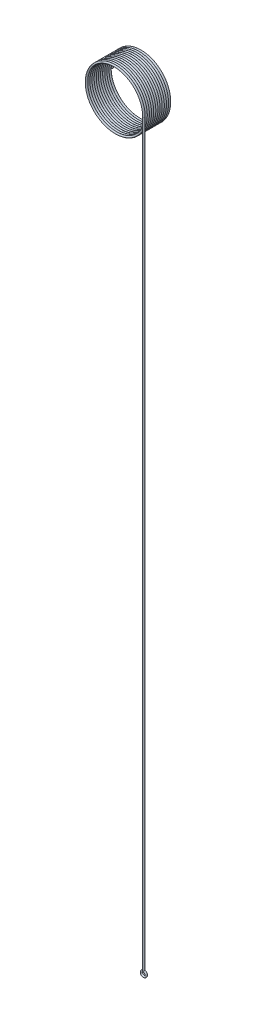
ISO-10303-21;
HEADER;
FILE_DESCRIPTION(('STEP AP214'),'2;1');
FILE_NAME('part.step','',(''),(''),'','','');
FILE_SCHEMA(('AUTOMOTIVE_DESIGN { 1 0 10303 214 1 1 1 1 }'));
ENDSEC;
DATA;
#1=APPLICATION_CONTEXT('core data for automotive mechanical design processes');
#2=APPLICATION_PROTOCOL_DEFINITION('international standard','automotive_design',2000,#1);
#3=PRODUCT_CONTEXT('',#1,'mechanical');
#4=PRODUCT('Part','Part','',(#3));
#5=PRODUCT_RELATED_PRODUCT_CATEGORY('part','',(#4));
#6=PRODUCT_DEFINITION_FORMATION('','',#4);
#7=PRODUCT_DEFINITION_CONTEXT('part definition',#1,'design');
#8=PRODUCT_DEFINITION('design','',#6,#7);
#9=PRODUCT_DEFINITION_SHAPE('','',#8);
#10=(LENGTH_UNIT() NAMED_UNIT(*) SI_UNIT(.MILLI.,.METRE.));
#11=(NAMED_UNIT(*) PLANE_ANGLE_UNIT() SI_UNIT($,.RADIAN.));
#12=(NAMED_UNIT(*) SI_UNIT($,.STERADIAN.) SOLID_ANGLE_UNIT());
#13=UNCERTAINTY_MEASURE_WITH_UNIT(LENGTH_MEASURE(1.E-05),#10,'distance_accuracy_value','');
#14=(GEOMETRIC_REPRESENTATION_CONTEXT(3) GLOBAL_UNCERTAINTY_ASSIGNED_CONTEXT((#13)) GLOBAL_UNIT_ASSIGNED_CONTEXT((#10,
#11,#12)) REPRESENTATION_CONTEXT('',''));
#15=CARTESIAN_POINT('',(0.,0.,0.));
#16=DIRECTION('',(0.,0.,1.));
#17=DIRECTION('',(1.,0.,0.));
#18=AXIS2_PLACEMENT_3D('',#15,#16,#17);
#19=CARTESIAN_POINT('',(19.75,0.,0.));
#20=DIRECTION('',(0.,-1.,0.));
#21=DIRECTION('',(1.,0.,0.));
#22=AXIS2_PLACEMENT_3D('',#19,#20,#21);
#23=CYLINDRICAL_SURFACE('',#22,0.6);
#24=CARTESIAN_POINT('',(19.75,0.,0.));
#25=DIRECTION('',(0.,1.,0.));
#26=DIRECTION('',(0.,0.,1.));
#27=AXIS2_PLACEMENT_3D('',#24,#25,#26);
#28=CIRCLE('',#27,0.6);
#29=CARTESIAN_POINT('',(19.75,0.,0.6));
#30=VERTEX_POINT('',#29);
#31=EDGE_CURVE('E11',#30,#30,#28,.T.);
#32=ORIENTED_EDGE('',*,*,#31,.F.);
#33=EDGE_LOOP('',(#32));
#34=FACE_BOUND('',#33,.T.);
#35=CARTESIAN_POINT('',(19.75,-500.,-0.600000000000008));
#36=CARTESIAN_POINT('',(19.7488453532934,-499.998845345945,-0.599999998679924));
#37=CARTESIAN_POINT('',(19.7476900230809,-499.997691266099,-0.599996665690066));
#38=CARTESIAN_POINT('',(19.710719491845,-499.960800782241,-0.599783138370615));
#39=CARTESIAN_POINT('',(19.6742642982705,-499.925625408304,-0.596366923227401));
#40=CARTESIAN_POINT('',(19.6009685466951,-499.856991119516,-0.582395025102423));
#41=CARTESIAN_POINT('',(19.5641274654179,-499.823535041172,-0.571827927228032));
#42=CARTESIAN_POINT('',(19.4964838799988,-499.763694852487,-0.544849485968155));
#43=CARTESIAN_POINT('',(19.4655648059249,-499.736980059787,-0.529477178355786));
#44=CARTESIAN_POINT('',(19.4054570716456,-499.686055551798,-0.492475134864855));
#45=CARTESIAN_POINT('',(19.3762658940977,-499.661842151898,-0.4708547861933));
#46=CARTESIAN_POINT('',(19.3264287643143,-499.621172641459,-0.426004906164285));
#47=CARTESIAN_POINT('',(19.3052308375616,-499.604127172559,-0.403926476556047));
#48=CARTESIAN_POINT('',(19.2657469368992,-499.572722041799,-0.355624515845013));
#49=CARTESIAN_POINT('',(19.2474580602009,-499.558359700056,-0.329405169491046));
#50=CARTESIAN_POINT('',(19.217304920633,-499.534875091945,-0.277479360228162));
#51=CARTESIAN_POINT('',(19.2048859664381,-499.52528745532,-0.252306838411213));
#52=CARTESIAN_POINT('',(19.1834943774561,-499.508855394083,-0.199690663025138));
#53=CARTESIAN_POINT('',(19.1745203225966,-499.502009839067,-0.172247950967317));
#54=CARTESIAN_POINT('',(19.1605275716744,-499.49136520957,-0.115652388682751));
#55=CARTESIAN_POINT('',(19.1555274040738,-499.487580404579,-0.0864922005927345));
#56=CARTESIAN_POINT('',(19.1499005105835,-499.483322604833,-0.0275145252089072));
#57=CARTESIAN_POINT('',(19.1492724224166,-499.482848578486,0.00230275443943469));
#58=CARTESIAN_POINT('',(19.1522971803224,-499.485135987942,0.0591009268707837));
#59=CARTESIAN_POINT('',(19.1556000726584,-499.487632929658,0.0861123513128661));
#60=CARTESIAN_POINT('',(19.1657167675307,-499.495309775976,0.139067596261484));
#61=CARTESIAN_POINT('',(19.1725305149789,-499.500489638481,0.165011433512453));
#62=CARTESIAN_POINT('',(19.1894202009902,-499.513400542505,0.215572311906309));
#63=CARTESIAN_POINT('',(19.1995419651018,-499.52116745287,0.240164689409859));
#64=CARTESIAN_POINT('',(19.2225264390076,-499.538933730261,0.287152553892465));
#65=CARTESIAN_POINT('',(19.2353899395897,-499.54893374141,0.309547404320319));
#66=CARTESIAN_POINT('',(19.2649679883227,-499.57213125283,0.354323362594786));
#67=CARTESIAN_POINT('',(19.2819564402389,-499.585565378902,0.376399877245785));
#68=CARTESIAN_POINT('',(19.318021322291,-499.614416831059,0.417300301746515));
#69=CARTESIAN_POINT('',(19.3370992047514,-499.62983553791,0.436121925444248));
#70=CARTESIAN_POINT('',(19.3861150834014,-499.669974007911,0.478622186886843));
#71=CARTESIAN_POINT('',(19.4169280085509,-499.695648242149,0.500398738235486));
#72=CARTESIAN_POINT('',(19.4802593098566,-499.749621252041,0.537202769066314));
#73=CARTESIAN_POINT('',(19.5127810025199,-499.777925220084,0.552216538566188));
#74=CARTESIAN_POINT('',(19.5791198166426,-499.837129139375,0.576258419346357));
#75=CARTESIAN_POINT('',(19.6129493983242,-499.86807458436,0.585136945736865));
#76=CARTESIAN_POINT('',(19.6802091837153,-499.931368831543,0.596902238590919));
#77=CARTESIAN_POINT('',(19.7136400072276,-499.96371494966,0.599799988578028));
#78=CARTESIAN_POINT('',(19.7476900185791,-499.997691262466,0.599996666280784));
#79=CARTESIAN_POINT('',(19.7488453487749,-499.998845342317,0.599999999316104));
#80=CARTESIAN_POINT('',(19.75,-500.,0.600000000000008));
#81=B_SPLINE_CURVE_WITH_KNOTS('',3,(#35,#36,#37,#38,#39,#40,#41,#42,#43,#44,#45,#46,#47,#48,#49,
#50,#51,#52,#53,#54,#55,#56,#57,#58,#59,#60,#61,#62,#63,#64,#65,#66,#67,#68,#69,#70,#71,#72,#73,
#74,#75,#76,#77,#78,#79,#80),.UNSPECIFIED.,.F.,.F.,(4,2,2,2,2,2,2,2,2,2,2,2,2,2,2,2,2,2,2,2,2,2,
4),(0.,0.00489899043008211,0.156677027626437,0.308697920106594,0.439199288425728,
0.569505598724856,0.67420559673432,0.778800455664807,0.867411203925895,0.955985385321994,
1.04497016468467,1.13392721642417,1.21552291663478,1.29711733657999,1.37989371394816,
1.4626939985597,1.55512536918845,1.64762139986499,1.78378587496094,1.92022516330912,
2.05988362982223,2.19928538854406,2.2041843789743),.UNSPECIFIED.);
#82=CARTESIAN_POINT('',(19.75,-500.,-0.600000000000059));
#83=VERTEX_POINT('',#82);
#84=CARTESIAN_POINT('',(19.75,-500.,0.6));
#85=VERTEX_POINT('',#84);
#86=EDGE_CURVE('E46',#83,#85,#81,.T.);
#87=ORIENTED_EDGE('',*,*,#86,.T.);
#88=CARTESIAN_POINT('',(19.75,-500.,0.600000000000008));
#89=CARTESIAN_POINT('',(19.7511546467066,-499.998845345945,0.599999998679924));
#90=CARTESIAN_POINT('',(19.7523099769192,-499.997691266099,0.599996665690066));
#91=CARTESIAN_POINT('',(19.789280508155,-499.960800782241,0.599783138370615));
#92=CARTESIAN_POINT('',(19.8257357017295,-499.925625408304,0.596366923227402));
#93=CARTESIAN_POINT('',(19.899031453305,-499.856991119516,0.582395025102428));
#94=CARTESIAN_POINT('',(19.9358725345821,-499.823535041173,0.571827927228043));
#95=CARTESIAN_POINT('',(20.0035161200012,-499.763694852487,0.544849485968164));
#96=CARTESIAN_POINT('',(20.0344351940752,-499.736980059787,0.529477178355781));
#97=CARTESIAN_POINT('',(20.0945429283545,-499.686055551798,0.492475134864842));
#98=CARTESIAN_POINT('',(20.1237341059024,-499.661842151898,0.4708547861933));
#99=CARTESIAN_POINT('',(20.1735712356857,-499.621172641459,0.426004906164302));
#100=CARTESIAN_POINT('',(20.1947691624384,-499.604127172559,0.403926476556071));
#101=CARTESIAN_POINT('',(20.2342530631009,-499.572722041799,0.355624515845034));
#102=CARTESIAN_POINT('',(20.2525419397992,-499.558359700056,0.329405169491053));
#103=CARTESIAN_POINT('',(20.282695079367,-499.534875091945,0.277479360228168));
#104=CARTESIAN_POINT('',(20.295114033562,-499.52528745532,0.252306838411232));
#105=CARTESIAN_POINT('',(20.3165056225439,-499.508855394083,0.199690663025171));
#106=CARTESIAN_POINT('',(20.3254796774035,-499.502009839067,0.172247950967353));
#107=CARTESIAN_POINT('',(20.3394724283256,-499.49136520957,0.115652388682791));
#108=CARTESIAN_POINT('',(20.3444725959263,-499.487580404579,0.0864922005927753));
#109=CARTESIAN_POINT('',(20.3500994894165,-499.483322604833,0.0275145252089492));
#110=CARTESIAN_POINT('',(20.3507275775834,-499.482848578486,-0.00230275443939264));
#111=CARTESIAN_POINT('',(20.3477028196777,-499.485135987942,-0.0591009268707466));
#112=CARTESIAN_POINT('',(20.3443999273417,-499.487632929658,-0.0861123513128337));
#113=CARTESIAN_POINT('',(20.3342832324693,-499.495309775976,-0.139067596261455));
#114=CARTESIAN_POINT('',(20.3274694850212,-499.500489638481,-0.165011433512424));
#115=CARTESIAN_POINT('',(20.3105797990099,-499.513400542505,-0.215572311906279));
#116=CARTESIAN_POINT('',(20.3004580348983,-499.52116745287,-0.240164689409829));
#117=CARTESIAN_POINT('',(20.2774735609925,-499.538933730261,-0.287152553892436));
#118=CARTESIAN_POINT('',(20.2646100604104,-499.54893374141,-0.309547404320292));
#119=CARTESIAN_POINT('',(20.2350320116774,-499.57213125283,-0.354323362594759));
#120=CARTESIAN_POINT('',(20.2180435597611,-499.585565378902,-0.376399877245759));
#121=CARTESIAN_POINT('',(20.181978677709,-499.614416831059,-0.417300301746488));
#122=CARTESIAN_POINT('',(20.1629007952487,-499.62983553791,-0.436121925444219));
#123=CARTESIAN_POINT('',(20.1138849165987,-499.669974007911,-0.478622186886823));
#124=CARTESIAN_POINT('',(20.0830719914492,-499.695648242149,-0.500398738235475));
#125=CARTESIAN_POINT('',(20.0197406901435,-499.749621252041,-0.537202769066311));
#126=CARTESIAN_POINT('',(19.9872189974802,-499.777925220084,-0.552216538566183));
#127=CARTESIAN_POINT('',(19.9208801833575,-499.837129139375,-0.576258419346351));
#128=CARTESIAN_POINT('',(19.8870506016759,-499.86807458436,-0.585136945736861));
#129=CARTESIAN_POINT('',(19.8197908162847,-499.931368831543,-0.596902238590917));
#130=CARTESIAN_POINT('',(19.7863599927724,-499.96371494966,-0.599799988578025));
#131=CARTESIAN_POINT('',(19.752309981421,-499.997691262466,-0.599996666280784));
#132=CARTESIAN_POINT('',(19.7511546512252,-499.998845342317,-0.599999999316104));
#133=CARTESIAN_POINT('',(19.75,-500.,-0.600000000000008));
#134=B_SPLINE_CURVE_WITH_KNOTS('',3,(#88,#89,#90,#91,#92,#93,#94,#95,#96,#97,#98,#99,#100,#101,
#102,#103,#104,#105,#106,#107,#108,#109,#110,#111,#112,#113,#114,#115,#116,#117,#118,#119,#120,
#121,#122,#123,#124,#125,#126,#127,#128,#129,#130,#131,#132,#133),.UNSPECIFIED.,.F.,.F.,(4,2,2,
2,2,2,2,2,2,2,2,2,2,2,2,2,2,2,2,2,2,2,4),(0.,0.00489899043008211,0.156677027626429,
0.308697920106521,0.439199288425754,0.569505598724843,0.674205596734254,0.77880045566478,
0.867411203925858,0.955985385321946,1.04497016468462,1.13392721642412,1.21552291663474,
1.29711733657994,1.37989371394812,1.46269399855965,1.55512536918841,1.64762139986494,
1.78378587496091,1.92022516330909,2.05988362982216,2.19928538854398,2.20418437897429),.UNSPECIFIED.);
#135=EDGE_CURVE('E44',#85,#83,#134,.T.);
#136=ORIENTED_EDGE('',*,*,#135,.T.);
#137=EDGE_LOOP('',(#87,#136));
#138=FACE_BOUND('',#137,.T.);
#139=ADVANCED_FACE('F30',(#34,#138),#23,.T.);
#140=CARTESIAN_POINT('',(-19.75,0.,-18.6));
#141=DIRECTION('',(0.,1.,0.));
#142=DIRECTION('',(-1.,0.,0.));
#143=AXIS2_PLACEMENT_3D('',#140,#141,#142);
#144=PLANE('',#143);
#145=CARTESIAN_POINT('',(-19.75,0.,-18.));
#146=DIRECTION('',(0.,1.,0.));
#147=DIRECTION('',(-1.,0.,0.));
#148=AXIS2_PLACEMENT_3D('',#145,#146,#147);
#149=CIRCLE('',#148,0.600000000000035);
#150=CARTESIAN_POINT('',(-20.35,0.,-18.));
#151=VERTEX_POINT('',#150);
#152=EDGE_CURVE('E38',#151,#151,#149,.T.);
#153=ORIENTED_EDGE('',*,*,#152,.F.);
#154=EDGE_LOOP('',(#153));
#155=FACE_BOUND('',#154,.T.);
#156=ADVANCED_FACE('F63',(#155),#144,.F.);
#157=CARTESIAN_POINT('',(19.75,0.,0.600000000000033));
#158=CARTESIAN_POINT('',(19.75,8.18071785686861,0.510000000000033));
#159=CARTESIAN_POINT('',(13.9653589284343,13.9653589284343,0.420000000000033));
#160=CARTESIAN_POINT('',(8.18071785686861,19.75,0.330000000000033));
#161=CARTESIAN_POINT('',(0.,19.75,0.240000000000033));
#162=CARTESIAN_POINT('',(-8.18071785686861,19.75,0.150000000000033));
#163=CARTESIAN_POINT('',(-13.9653589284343,13.9653589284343,0.0600000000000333));
#164=CARTESIAN_POINT('',(-19.75,8.18071785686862,-0.0299999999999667));
#165=CARTESIAN_POINT('',(-19.75,0.,-0.119999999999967));
#166=CARTESIAN_POINT('',(-19.75,-8.18071785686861,-0.209999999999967));
#167=CARTESIAN_POINT('',(-13.9653589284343,-13.9653589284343,-0.299999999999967));
#168=CARTESIAN_POINT('',(-8.18071785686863,-19.75,-0.389999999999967));
#169=CARTESIAN_POINT('',(0.,-19.75,-0.479999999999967));
#170=CARTESIAN_POINT('',(8.18071785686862,-19.75,-0.569999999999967));
#171=CARTESIAN_POINT('',(13.9653589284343,-13.9653589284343,-0.659999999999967));
#172=CARTESIAN_POINT('',(19.75,-8.18071785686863,-0.749999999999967));
#173=CARTESIAN_POINT('',(19.75,0.,-0.839999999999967));
#174=CARTESIAN_POINT('',(19.75,8.18071785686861,-0.929999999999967));
#175=CARTESIAN_POINT('',(13.9653589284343,13.9653589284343,-1.01999999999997));
#176=CARTESIAN_POINT('',(8.18071785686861,19.75,-1.10999999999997));
#177=CARTESIAN_POINT('',(0.,19.75,-1.19999999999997));
#178=CARTESIAN_POINT('',(-8.18071785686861,19.75,-1.28999999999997));
#179=CARTESIAN_POINT('',(-13.9653589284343,13.9653589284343,-1.37999999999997));
#180=CARTESIAN_POINT('',(-19.75,8.18071785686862,-1.46999999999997));
#181=CARTESIAN_POINT('',(-19.75,0.,-1.55999999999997));
#182=CARTESIAN_POINT('',(-19.75,-8.18071785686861,-1.64999999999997));
#183=CARTESIAN_POINT('',(-13.9653589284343,-13.9653589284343,-1.73999999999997));
#184=CARTESIAN_POINT('',(-8.18071785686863,-19.75,-1.82999999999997));
#185=CARTESIAN_POINT('',(0.,-19.75,-1.91999999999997));
#186=CARTESIAN_POINT('',(8.18071785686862,-19.75,-2.00999999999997));
#187=CARTESIAN_POINT('',(13.9653589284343,-13.9653589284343,-2.09999999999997));
#188=CARTESIAN_POINT('',(19.75,-8.18071785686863,-2.18999999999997));
#189=CARTESIAN_POINT('',(19.75,0.,-2.27999999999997));
#190=CARTESIAN_POINT('',(19.75,8.18071785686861,-2.36999999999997));
#191=CARTESIAN_POINT('',(13.9653589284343,13.9653589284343,-2.45999999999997));
#192=CARTESIAN_POINT('',(8.18071785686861,19.75,-2.54999999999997));
#193=CARTESIAN_POINT('',(0.,19.75,-2.63999999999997));
#194=CARTESIAN_POINT('',(-8.18071785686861,19.75,-2.72999999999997));
#195=CARTESIAN_POINT('',(-13.9653589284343,13.9653589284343,-2.81999999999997));
#196=CARTESIAN_POINT('',(-19.75,8.18071785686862,-2.90999999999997));
#197=CARTESIAN_POINT('',(-19.75,0.,-2.99999999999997));
#198=CARTESIAN_POINT('',(-19.75,-8.18071785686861,-3.08999999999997));
#199=CARTESIAN_POINT('',(-13.9653589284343,-13.9653589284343,-3.17999999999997));
#200=CARTESIAN_POINT('',(-8.18071785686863,-19.75,-3.26999999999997));
#201=CARTESIAN_POINT('',(0.,-19.75,-3.35999999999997));
#202=CARTESIAN_POINT('',(8.18071785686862,-19.75,-3.44999999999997));
#203=CARTESIAN_POINT('',(13.9653589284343,-13.9653589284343,-3.53999999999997));
#204=CARTESIAN_POINT('',(19.75,-8.18071785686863,-3.62999999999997));
#205=CARTESIAN_POINT('',(19.75,0.,-3.71999999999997));
#206=CARTESIAN_POINT('',(19.75,8.18071785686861,-3.80999999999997));
#207=CARTESIAN_POINT('',(13.9653589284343,13.9653589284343,-3.89999999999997));
#208=CARTESIAN_POINT('',(8.18071785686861,19.75,-3.98999999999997));
#209=CARTESIAN_POINT('',(0.,19.75,-4.07999999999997));
#210=CARTESIAN_POINT('',(-8.18071785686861,19.75,-4.16999999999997));
#211=CARTESIAN_POINT('',(-13.9653589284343,13.9653589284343,-4.25999999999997));
#212=CARTESIAN_POINT('',(-19.75,8.18071785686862,-4.34999999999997));
#213=CARTESIAN_POINT('',(-19.75,0.,-4.43999999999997));
#214=CARTESIAN_POINT('',(-19.75,-8.18071785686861,-4.52999999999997));
#215=CARTESIAN_POINT('',(-13.9653589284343,-13.9653589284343,-4.61999999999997));
#216=CARTESIAN_POINT('',(-8.18071785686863,-19.75,-4.70999999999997));
#217=CARTESIAN_POINT('',(0.,-19.75,-4.79999999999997));
#218=CARTESIAN_POINT('',(8.18071785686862,-19.75,-4.88999999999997));
#219=CARTESIAN_POINT('',(13.9653589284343,-13.9653589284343,-4.97999999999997));
#220=CARTESIAN_POINT('',(19.75,-8.18071785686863,-5.06999999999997));
#221=CARTESIAN_POINT('',(19.75,0.,-5.15999999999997));
#222=CARTESIAN_POINT('',(19.75,8.18071785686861,-5.24999999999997));
#223=CARTESIAN_POINT('',(13.9653589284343,13.9653589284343,-5.33999999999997));
#224=CARTESIAN_POINT('',(8.18071785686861,19.75,-5.42999999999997));
#225=CARTESIAN_POINT('',(0.,19.75,-5.51999999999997));
#226=CARTESIAN_POINT('',(-8.18071785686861,19.75,-5.60999999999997));
#227=CARTESIAN_POINT('',(-13.9653589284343,13.9653589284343,-5.69999999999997));
#228=CARTESIAN_POINT('',(-19.75,8.18071785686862,-5.78999999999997));
#229=CARTESIAN_POINT('',(-19.75,0.,-5.87999999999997));
#230=CARTESIAN_POINT('',(-19.75,-8.18071785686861,-5.96999999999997));
#231=CARTESIAN_POINT('',(-13.9653589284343,-13.9653589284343,-6.05999999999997));
#232=CARTESIAN_POINT('',(-8.18071785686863,-19.75,-6.14999999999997));
#233=CARTESIAN_POINT('',(0.,-19.75,-6.23999999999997));
#234=CARTESIAN_POINT('',(8.18071785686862,-19.75,-6.32999999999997));
#235=CARTESIAN_POINT('',(13.9653589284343,-13.9653589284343,-6.41999999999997));
#236=CARTESIAN_POINT('',(19.75,-8.18071785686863,-6.50999999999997));
#237=CARTESIAN_POINT('',(19.75,0.,-6.59999999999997));
#238=CARTESIAN_POINT('',(19.75,8.18071785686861,-6.68999999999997));
#239=CARTESIAN_POINT('',(13.9653589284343,13.9653589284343,-6.77999999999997));
#240=CARTESIAN_POINT('',(8.18071785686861,19.75,-6.86999999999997));
#241=CARTESIAN_POINT('',(0.,19.75,-6.95999999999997));
#242=CARTESIAN_POINT('',(-8.18071785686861,19.75,-7.04999999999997));
#243=CARTESIAN_POINT('',(-13.9653589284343,13.9653589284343,-7.13999999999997));
#244=CARTESIAN_POINT('',(-19.75,8.18071785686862,-7.22999999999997));
#245=CARTESIAN_POINT('',(-19.75,0.,-7.31999999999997));
#246=CARTESIAN_POINT('',(-19.75,-8.18071785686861,-7.40999999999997));
#247=CARTESIAN_POINT('',(-13.9653589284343,-13.9653589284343,-7.49999999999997));
#248=CARTESIAN_POINT('',(-8.18071785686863,-19.75,-7.58999999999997));
#249=CARTESIAN_POINT('',(0.,-19.75,-7.67999999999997));
#250=CARTESIAN_POINT('',(8.18071785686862,-19.75,-7.76999999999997));
#251=CARTESIAN_POINT('',(13.9653589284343,-13.9653589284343,-7.85999999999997));
#252=CARTESIAN_POINT('',(19.75,-8.18071785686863,-7.94999999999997));
#253=CARTESIAN_POINT('',(19.75,0.,-8.03999999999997));
#254=CARTESIAN_POINT('',(19.75,8.18071785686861,-8.12999999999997));
#255=CARTESIAN_POINT('',(13.9653589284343,13.9653589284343,-8.21999999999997));
#256=CARTESIAN_POINT('',(8.18071785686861,19.75,-8.30999999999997));
#257=CARTESIAN_POINT('',(0.,19.75,-8.39999999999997));
#258=CARTESIAN_POINT('',(-8.18071785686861,19.75,-8.48999999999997));
#259=CARTESIAN_POINT('',(-13.9653589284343,13.9653589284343,-8.57999999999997));
#260=CARTESIAN_POINT('',(-19.75,8.18071785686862,-8.66999999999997));
#261=CARTESIAN_POINT('',(-19.75,0.,-8.75999999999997));
#262=CARTESIAN_POINT('',(-19.75,-8.18071785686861,-8.84999999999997));
#263=CARTESIAN_POINT('',(-13.9653589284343,-13.9653589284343,-8.93999999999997));
#264=CARTESIAN_POINT('',(-8.18071785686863,-19.75,-9.02999999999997));
#265=CARTESIAN_POINT('',(0.,-19.75,-9.11999999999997));
#266=CARTESIAN_POINT('',(8.18071785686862,-19.75,-9.20999999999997));
#267=CARTESIAN_POINT('',(13.9653589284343,-13.9653589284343,-9.29999999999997));
#268=CARTESIAN_POINT('',(19.75,-8.18071785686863,-9.38999999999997));
#269=CARTESIAN_POINT('',(19.75,0.,-9.47999999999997));
#270=CARTESIAN_POINT('',(19.75,8.18071785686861,-9.56999999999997));
#271=CARTESIAN_POINT('',(13.9653589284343,13.9653589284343,-9.65999999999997));
#272=CARTESIAN_POINT('',(8.18071785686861,19.75,-9.74999999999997));
#273=CARTESIAN_POINT('',(0.,19.75,-9.83999999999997));
#274=CARTESIAN_POINT('',(-8.18071785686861,19.75,-9.92999999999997));
#275=CARTESIAN_POINT('',(-13.9653589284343,13.9653589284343,-10.02));
#276=CARTESIAN_POINT('',(-19.75,8.18071785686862,-10.11));
#277=CARTESIAN_POINT('',(-19.75,0.,-10.2));
#278=CARTESIAN_POINT('',(-19.75,-8.18071785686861,-10.29));
#279=CARTESIAN_POINT('',(-13.9653589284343,-13.9653589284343,-10.38));
#280=CARTESIAN_POINT('',(-8.18071785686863,-19.75,-10.47));
#281=CARTESIAN_POINT('',(0.,-19.75,-10.56));
#282=CARTESIAN_POINT('',(8.18071785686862,-19.75,-10.65));
#283=CARTESIAN_POINT('',(13.9653589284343,-13.9653589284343,-10.74));
#284=CARTESIAN_POINT('',(19.75,-8.18071785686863,-10.83));
#285=CARTESIAN_POINT('',(19.75,0.,-10.92));
#286=CARTESIAN_POINT('',(19.75,8.18071785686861,-11.01));
#287=CARTESIAN_POINT('',(13.9653589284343,13.9653589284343,-11.1));
#288=CARTESIAN_POINT('',(8.18071785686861,19.75,-11.19));
#289=CARTESIAN_POINT('',(0.,19.75,-11.28));
#290=CARTESIAN_POINT('',(-8.18071785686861,19.75,-11.37));
#291=CARTESIAN_POINT('',(-13.9653589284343,13.9653589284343,-11.46));
#292=CARTESIAN_POINT('',(-19.75,8.18071785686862,-11.55));
#293=CARTESIAN_POINT('',(-19.75,0.,-11.64));
#294=CARTESIAN_POINT('',(-19.75,-8.18071785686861,-11.73));
#295=CARTESIAN_POINT('',(-13.9653589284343,-13.9653589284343,-11.82));
#296=CARTESIAN_POINT('',(-8.18071785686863,-19.75,-11.91));
#297=CARTESIAN_POINT('',(0.,-19.75,-12.));
#298=CARTESIAN_POINT('',(8.18071785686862,-19.75,-12.09));
#299=CARTESIAN_POINT('',(13.9653589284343,-13.9653589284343,-12.18));
#300=CARTESIAN_POINT('',(19.75,-8.18071785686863,-12.27));
#301=CARTESIAN_POINT('',(19.75,0.,-12.36));
#302=CARTESIAN_POINT('',(19.75,8.18071785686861,-12.45));
#303=CARTESIAN_POINT('',(13.9653589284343,13.9653589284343,-12.54));
#304=CARTESIAN_POINT('',(8.18071785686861,19.75,-12.63));
#305=CARTESIAN_POINT('',(0.,19.75,-12.72));
#306=CARTESIAN_POINT('',(-8.18071785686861,19.75,-12.81));
#307=CARTESIAN_POINT('',(-13.9653589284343,13.9653589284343,-12.9));
#308=CARTESIAN_POINT('',(-19.75,8.18071785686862,-12.99));
#309=CARTESIAN_POINT('',(-19.75,0.,-13.08));
#310=CARTESIAN_POINT('',(-19.75,-8.18071785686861,-13.17));
#311=CARTESIAN_POINT('',(-13.9653589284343,-13.9653589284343,-13.26));
#312=CARTESIAN_POINT('',(-8.18071785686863,-19.75,-13.35));
#313=CARTESIAN_POINT('',(0.,-19.75,-13.44));
#314=CARTESIAN_POINT('',(8.18071785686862,-19.75,-13.53));
#315=CARTESIAN_POINT('',(13.9653589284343,-13.9653589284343,-13.62));
#316=CARTESIAN_POINT('',(19.75,-8.18071785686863,-13.71));
#317=CARTESIAN_POINT('',(19.75,0.,-13.8));
#318=CARTESIAN_POINT('',(19.75,8.18071785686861,-13.89));
#319=CARTESIAN_POINT('',(13.9653589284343,13.9653589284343,-13.98));
#320=CARTESIAN_POINT('',(8.18071785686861,19.75,-14.07));
#321=CARTESIAN_POINT('',(0.,19.75,-14.16));
#322=CARTESIAN_POINT('',(-8.18071785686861,19.75,-14.25));
#323=CARTESIAN_POINT('',(-13.9653589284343,13.9653589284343,-14.34));
#324=CARTESIAN_POINT('',(-19.75,8.18071785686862,-14.43));
#325=CARTESIAN_POINT('',(-19.75,0.,-14.52));
#326=CARTESIAN_POINT('',(-19.75,-8.18071785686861,-14.61));
#327=CARTESIAN_POINT('',(-13.9653589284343,-13.9653589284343,-14.7));
#328=CARTESIAN_POINT('',(-8.18071785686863,-19.75,-14.79));
#329=CARTESIAN_POINT('',(0.,-19.75,-14.88));
#330=CARTESIAN_POINT('',(8.18071785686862,-19.75,-14.97));
#331=CARTESIAN_POINT('',(13.9653589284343,-13.9653589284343,-15.06));
#332=CARTESIAN_POINT('',(19.75,-8.18071785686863,-15.15));
#333=CARTESIAN_POINT('',(19.75,0.,-15.24));
#334=CARTESIAN_POINT('',(19.75,8.18071785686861,-15.33));
#335=CARTESIAN_POINT('',(13.9653589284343,13.9653589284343,-15.42));
#336=CARTESIAN_POINT('',(8.18071785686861,19.75,-15.51));
#337=CARTESIAN_POINT('',(0.,19.75,-15.6));
#338=CARTESIAN_POINT('',(-8.18071785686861,19.75,-15.69));
#339=CARTESIAN_POINT('',(-13.9653589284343,13.9653589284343,-15.78));
#340=CARTESIAN_POINT('',(-19.75,8.18071785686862,-15.87));
#341=CARTESIAN_POINT('',(-19.75,0.,-15.96));
#342=CARTESIAN_POINT('',(-19.75,-8.18071785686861,-16.05));
#343=CARTESIAN_POINT('',(-13.9653589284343,-13.9653589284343,-16.14));
#344=CARTESIAN_POINT('',(-8.18071785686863,-19.75,-16.23));
#345=CARTESIAN_POINT('',(0.,-19.75,-16.32));
#346=CARTESIAN_POINT('',(8.18071785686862,-19.75,-16.41));
#347=CARTESIAN_POINT('',(13.9653589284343,-13.9653589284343,-16.5));
#348=CARTESIAN_POINT('',(19.75,-8.18071785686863,-16.59));
#349=CARTESIAN_POINT('',(19.75,0.,-16.68));
#350=CARTESIAN_POINT('',(19.75,8.18071785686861,-16.77));
#351=CARTESIAN_POINT('',(13.9653589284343,13.9653589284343,-16.86));
#352=CARTESIAN_POINT('',(8.18071785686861,19.75,-16.95));
#353=CARTESIAN_POINT('',(0.,19.75,-17.04));
#354=CARTESIAN_POINT('',(-8.18071785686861,19.75,-17.13));
#355=CARTESIAN_POINT('',(-13.9653589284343,13.9653589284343,-17.22));
#356=CARTESIAN_POINT('',(-19.75,8.18071785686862,-17.31));
#357=CARTESIAN_POINT('',(-19.75,0.,-17.4));
#358=CARTESIAN_POINT('',(20.95,0.,0.600000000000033));
#359=CARTESIAN_POINT('',(20.95,8.67777413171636,0.510000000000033));
#360=CARTESIAN_POINT('',(14.8138870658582,14.8138870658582,0.420000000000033));
#361=CARTESIAN_POINT('',(8.67777413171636,20.95,0.330000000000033));
#362=CARTESIAN_POINT('',(0.,20.95,0.240000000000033));
#363=CARTESIAN_POINT('',(-8.67777413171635,20.95,0.150000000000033));
#364=CARTESIAN_POINT('',(-14.8138870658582,14.8138870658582,0.0600000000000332));
#365=CARTESIAN_POINT('',(-20.95,8.67777413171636,-0.0299999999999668));
#366=CARTESIAN_POINT('',(-20.95,0.,-0.119999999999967));
#367=CARTESIAN_POINT('',(-20.95,-8.67777413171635,-0.209999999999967));
#368=CARTESIAN_POINT('',(-14.8138870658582,-14.8138870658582,-0.299999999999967));
#369=CARTESIAN_POINT('',(-8.67777413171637,-20.95,-0.389999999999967));
#370=CARTESIAN_POINT('',(0.,-20.95,-0.479999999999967));
#371=CARTESIAN_POINT('',(8.67777413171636,-20.95,-0.569999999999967));
#372=CARTESIAN_POINT('',(14.8138870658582,-14.8138870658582,-0.659999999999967));
#373=CARTESIAN_POINT('',(20.95,-8.67777413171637,-0.749999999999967));
#374=CARTESIAN_POINT('',(20.95,0.,-0.839999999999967));
#375=CARTESIAN_POINT('',(20.95,8.67777413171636,-0.929999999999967));
#376=CARTESIAN_POINT('',(14.8138870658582,14.8138870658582,-1.01999999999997));
#377=CARTESIAN_POINT('',(8.67777413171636,20.95,-1.10999999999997));
#378=CARTESIAN_POINT('',(0.,20.95,-1.19999999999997));
#379=CARTESIAN_POINT('',(-8.67777413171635,20.95,-1.28999999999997));
#380=CARTESIAN_POINT('',(-14.8138870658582,14.8138870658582,-1.37999999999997));
#381=CARTESIAN_POINT('',(-20.95,8.67777413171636,-1.46999999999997));
#382=CARTESIAN_POINT('',(-20.95,0.,-1.55999999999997));
#383=CARTESIAN_POINT('',(-20.95,-8.67777413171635,-1.64999999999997));
#384=CARTESIAN_POINT('',(-14.8138870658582,-14.8138870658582,-1.73999999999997));
#385=CARTESIAN_POINT('',(-8.67777413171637,-20.95,-1.82999999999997));
#386=CARTESIAN_POINT('',(0.,-20.95,-1.91999999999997));
#387=CARTESIAN_POINT('',(8.67777413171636,-20.95,-2.00999999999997));
#388=CARTESIAN_POINT('',(14.8138870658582,-14.8138870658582,-2.09999999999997));
#389=CARTESIAN_POINT('',(20.95,-8.67777413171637,-2.18999999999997));
#390=CARTESIAN_POINT('',(20.95,0.,-2.27999999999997));
#391=CARTESIAN_POINT('',(20.95,8.67777413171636,-2.36999999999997));
#392=CARTESIAN_POINT('',(14.8138870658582,14.8138870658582,-2.45999999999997));
#393=CARTESIAN_POINT('',(8.67777413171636,20.95,-2.54999999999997));
#394=CARTESIAN_POINT('',(0.,20.95,-2.63999999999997));
#395=CARTESIAN_POINT('',(-8.67777413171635,20.95,-2.72999999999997));
#396=CARTESIAN_POINT('',(-14.8138870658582,14.8138870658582,-2.81999999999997));
#397=CARTESIAN_POINT('',(-20.95,8.67777413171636,-2.90999999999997));
#398=CARTESIAN_POINT('',(-20.95,0.,-2.99999999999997));
#399=CARTESIAN_POINT('',(-20.95,-8.67777413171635,-3.08999999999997));
#400=CARTESIAN_POINT('',(-14.8138870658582,-14.8138870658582,-3.17999999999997));
#401=CARTESIAN_POINT('',(-8.67777413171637,-20.95,-3.26999999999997));
#402=CARTESIAN_POINT('',(0.,-20.95,-3.35999999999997));
#403=CARTESIAN_POINT('',(8.67777413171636,-20.95,-3.44999999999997));
#404=CARTESIAN_POINT('',(14.8138870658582,-14.8138870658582,-3.53999999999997));
#405=CARTESIAN_POINT('',(20.95,-8.67777413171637,-3.62999999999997));
#406=CARTESIAN_POINT('',(20.95,0.,-3.71999999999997));
#407=CARTESIAN_POINT('',(20.95,8.67777413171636,-3.80999999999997));
#408=CARTESIAN_POINT('',(14.8138870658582,14.8138870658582,-3.89999999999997));
#409=CARTESIAN_POINT('',(8.67777413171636,20.95,-3.98999999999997));
#410=CARTESIAN_POINT('',(0.,20.95,-4.07999999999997));
#411=CARTESIAN_POINT('',(-8.67777413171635,20.95,-4.16999999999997));
#412=CARTESIAN_POINT('',(-14.8138870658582,14.8138870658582,-4.25999999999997));
#413=CARTESIAN_POINT('',(-20.95,8.67777413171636,-4.34999999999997));
#414=CARTESIAN_POINT('',(-20.95,0.,-4.43999999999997));
#415=CARTESIAN_POINT('',(-20.95,-8.67777413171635,-4.52999999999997));
#416=CARTESIAN_POINT('',(-14.8138870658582,-14.8138870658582,-4.61999999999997));
#417=CARTESIAN_POINT('',(-8.67777413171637,-20.95,-4.70999999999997));
#418=CARTESIAN_POINT('',(0.,-20.95,-4.79999999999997));
#419=CARTESIAN_POINT('',(8.67777413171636,-20.95,-4.88999999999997));
#420=CARTESIAN_POINT('',(14.8138870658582,-14.8138870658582,-4.97999999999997));
#421=CARTESIAN_POINT('',(20.95,-8.67777413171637,-5.06999999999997));
#422=CARTESIAN_POINT('',(20.95,0.,-5.15999999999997));
#423=CARTESIAN_POINT('',(20.95,8.67777413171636,-5.24999999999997));
#424=CARTESIAN_POINT('',(14.8138870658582,14.8138870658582,-5.33999999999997));
#425=CARTESIAN_POINT('',(8.67777413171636,20.95,-5.42999999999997));
#426=CARTESIAN_POINT('',(0.,20.95,-5.51999999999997));
#427=CARTESIAN_POINT('',(-8.67777413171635,20.95,-5.60999999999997));
#428=CARTESIAN_POINT('',(-14.8138870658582,14.8138870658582,-5.69999999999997));
#429=CARTESIAN_POINT('',(-20.95,8.67777413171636,-5.78999999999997));
#430=CARTESIAN_POINT('',(-20.95,0.,-5.87999999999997));
#431=CARTESIAN_POINT('',(-20.95,-8.67777413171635,-5.96999999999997));
#432=CARTESIAN_POINT('',(-14.8138870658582,-14.8138870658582,-6.05999999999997));
#433=CARTESIAN_POINT('',(-8.67777413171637,-20.95,-6.14999999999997));
#434=CARTESIAN_POINT('',(0.,-20.95,-6.23999999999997));
#435=CARTESIAN_POINT('',(8.67777413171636,-20.95,-6.32999999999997));
#436=CARTESIAN_POINT('',(14.8138870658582,-14.8138870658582,-6.41999999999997));
#437=CARTESIAN_POINT('',(20.95,-8.67777413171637,-6.50999999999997));
#438=CARTESIAN_POINT('',(20.95,0.,-6.59999999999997));
#439=CARTESIAN_POINT('',(20.95,8.67777413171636,-6.68999999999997));
#440=CARTESIAN_POINT('',(14.8138870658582,14.8138870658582,-6.77999999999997));
#441=CARTESIAN_POINT('',(8.67777413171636,20.95,-6.86999999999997));
#442=CARTESIAN_POINT('',(0.,20.95,-6.95999999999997));
#443=CARTESIAN_POINT('',(-8.67777413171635,20.95,-7.04999999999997));
#444=CARTESIAN_POINT('',(-14.8138870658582,14.8138870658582,-7.13999999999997));
#445=CARTESIAN_POINT('',(-20.95,8.67777413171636,-7.22999999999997));
#446=CARTESIAN_POINT('',(-20.95,0.,-7.31999999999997));
#447=CARTESIAN_POINT('',(-20.95,-8.67777413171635,-7.40999999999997));
#448=CARTESIAN_POINT('',(-14.8138870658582,-14.8138870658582,-7.49999999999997));
#449=CARTESIAN_POINT('',(-8.67777413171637,-20.95,-7.58999999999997));
#450=CARTESIAN_POINT('',(0.,-20.95,-7.67999999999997));
#451=CARTESIAN_POINT('',(8.67777413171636,-20.95,-7.76999999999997));
#452=CARTESIAN_POINT('',(14.8138870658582,-14.8138870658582,-7.85999999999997));
#453=CARTESIAN_POINT('',(20.95,-8.67777413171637,-7.94999999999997));
#454=CARTESIAN_POINT('',(20.95,0.,-8.03999999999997));
#455=CARTESIAN_POINT('',(20.95,8.67777413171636,-8.12999999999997));
#456=CARTESIAN_POINT('',(14.8138870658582,14.8138870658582,-8.21999999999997));
#457=CARTESIAN_POINT('',(8.67777413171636,20.95,-8.30999999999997));
#458=CARTESIAN_POINT('',(0.,20.95,-8.39999999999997));
#459=CARTESIAN_POINT('',(-8.67777413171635,20.95,-8.48999999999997));
#460=CARTESIAN_POINT('',(-14.8138870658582,14.8138870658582,-8.57999999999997));
#461=CARTESIAN_POINT('',(-20.95,8.67777413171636,-8.66999999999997));
#462=CARTESIAN_POINT('',(-20.95,0.,-8.75999999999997));
#463=CARTESIAN_POINT('',(-20.95,-8.67777413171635,-8.84999999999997));
#464=CARTESIAN_POINT('',(-14.8138870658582,-14.8138870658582,-8.93999999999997));
#465=CARTESIAN_POINT('',(-8.67777413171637,-20.95,-9.02999999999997));
#466=CARTESIAN_POINT('',(0.,-20.95,-9.11999999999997));
#467=CARTESIAN_POINT('',(8.67777413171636,-20.95,-9.20999999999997));
#468=CARTESIAN_POINT('',(14.8138870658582,-14.8138870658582,-9.29999999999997));
#469=CARTESIAN_POINT('',(20.95,-8.67777413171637,-9.38999999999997));
#470=CARTESIAN_POINT('',(20.95,0.,-9.47999999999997));
#471=CARTESIAN_POINT('',(20.95,8.67777413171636,-9.56999999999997));
#472=CARTESIAN_POINT('',(14.8138870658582,14.8138870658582,-9.65999999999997));
#473=CARTESIAN_POINT('',(8.67777413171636,20.95,-9.74999999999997));
#474=CARTESIAN_POINT('',(0.,20.95,-9.83999999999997));
#475=CARTESIAN_POINT('',(-8.67777413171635,20.95,-9.92999999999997));
#476=CARTESIAN_POINT('',(-14.8138870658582,14.8138870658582,-10.02));
#477=CARTESIAN_POINT('',(-20.95,8.67777413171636,-10.11));
#478=CARTESIAN_POINT('',(-20.95,0.,-10.2));
#479=CARTESIAN_POINT('',(-20.95,-8.67777413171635,-10.29));
#480=CARTESIAN_POINT('',(-14.8138870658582,-14.8138870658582,-10.38));
#481=CARTESIAN_POINT('',(-8.67777413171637,-20.95,-10.47));
#482=CARTESIAN_POINT('',(0.,-20.95,-10.56));
#483=CARTESIAN_POINT('',(8.67777413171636,-20.95,-10.65));
#484=CARTESIAN_POINT('',(14.8138870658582,-14.8138870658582,-10.74));
#485=CARTESIAN_POINT('',(20.95,-8.67777413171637,-10.83));
#486=CARTESIAN_POINT('',(20.95,0.,-10.92));
#487=CARTESIAN_POINT('',(20.95,8.67777413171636,-11.01));
#488=CARTESIAN_POINT('',(14.8138870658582,14.8138870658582,-11.1));
#489=CARTESIAN_POINT('',(8.67777413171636,20.95,-11.19));
#490=CARTESIAN_POINT('',(0.,20.95,-11.28));
#491=CARTESIAN_POINT('',(-8.67777413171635,20.95,-11.37));
#492=CARTESIAN_POINT('',(-14.8138870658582,14.8138870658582,-11.46));
#493=CARTESIAN_POINT('',(-20.95,8.67777413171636,-11.55));
#494=CARTESIAN_POINT('',(-20.95,0.,-11.64));
#495=CARTESIAN_POINT('',(-20.95,-8.67777413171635,-11.73));
#496=CARTESIAN_POINT('',(-14.8138870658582,-14.8138870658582,-11.82));
#497=CARTESIAN_POINT('',(-8.67777413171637,-20.95,-11.91));
#498=CARTESIAN_POINT('',(0.,-20.95,-12.));
#499=CARTESIAN_POINT('',(8.67777413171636,-20.95,-12.09));
#500=CARTESIAN_POINT('',(14.8138870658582,-14.8138870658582,-12.18));
#501=CARTESIAN_POINT('',(20.95,-8.67777413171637,-12.27));
#502=CARTESIAN_POINT('',(20.95,0.,-12.36));
#503=CARTESIAN_POINT('',(20.95,8.67777413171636,-12.45));
#504=CARTESIAN_POINT('',(14.8138870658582,14.8138870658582,-12.54));
#505=CARTESIAN_POINT('',(8.67777413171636,20.95,-12.63));
#506=CARTESIAN_POINT('',(0.,20.95,-12.72));
#507=CARTESIAN_POINT('',(-8.67777413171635,20.95,-12.81));
#508=CARTESIAN_POINT('',(-14.8138870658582,14.8138870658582,-12.9));
#509=CARTESIAN_POINT('',(-20.95,8.67777413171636,-12.99));
#510=CARTESIAN_POINT('',(-20.95,0.,-13.08));
#511=CARTESIAN_POINT('',(-20.95,-8.67777413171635,-13.17));
#512=CARTESIAN_POINT('',(-14.8138870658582,-14.8138870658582,-13.26));
#513=CARTESIAN_POINT('',(-8.67777413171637,-20.95,-13.35));
#514=CARTESIAN_POINT('',(0.,-20.95,-13.44));
#515=CARTESIAN_POINT('',(8.67777413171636,-20.95,-13.53));
#516=CARTESIAN_POINT('',(14.8138870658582,-14.8138870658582,-13.62));
#517=CARTESIAN_POINT('',(20.95,-8.67777413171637,-13.71));
#518=CARTESIAN_POINT('',(20.95,0.,-13.8));
#519=CARTESIAN_POINT('',(20.95,8.67777413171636,-13.89));
#520=CARTESIAN_POINT('',(14.8138870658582,14.8138870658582,-13.98));
#521=CARTESIAN_POINT('',(8.67777413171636,20.95,-14.07));
#522=CARTESIAN_POINT('',(0.,20.95,-14.16));
#523=CARTESIAN_POINT('',(-8.67777413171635,20.95,-14.25));
#524=CARTESIAN_POINT('',(-14.8138870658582,14.8138870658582,-14.34));
#525=CARTESIAN_POINT('',(-20.95,8.67777413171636,-14.43));
#526=CARTESIAN_POINT('',(-20.95,0.,-14.52));
#527=CARTESIAN_POINT('',(-20.95,-8.67777413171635,-14.61));
#528=CARTESIAN_POINT('',(-14.8138870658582,-14.8138870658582,-14.7));
#529=CARTESIAN_POINT('',(-8.67777413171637,-20.95,-14.79));
#530=CARTESIAN_POINT('',(0.,-20.95,-14.88));
#531=CARTESIAN_POINT('',(8.67777413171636,-20.95,-14.97));
#532=CARTESIAN_POINT('',(14.8138870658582,-14.8138870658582,-15.06));
#533=CARTESIAN_POINT('',(20.95,-8.67777413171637,-15.15));
#534=CARTESIAN_POINT('',(20.95,0.,-15.24));
#535=CARTESIAN_POINT('',(20.95,8.67777413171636,-15.33));
#536=CARTESIAN_POINT('',(14.8138870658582,14.8138870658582,-15.42));
#537=CARTESIAN_POINT('',(8.67777413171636,20.95,-15.51));
#538=CARTESIAN_POINT('',(0.,20.95,-15.6));
#539=CARTESIAN_POINT('',(-8.67777413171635,20.95,-15.69));
#540=CARTESIAN_POINT('',(-14.8138870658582,14.8138870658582,-15.78));
#541=CARTESIAN_POINT('',(-20.95,8.67777413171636,-15.87));
#542=CARTESIAN_POINT('',(-20.95,0.,-15.96));
#543=CARTESIAN_POINT('',(-20.95,-8.67777413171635,-16.05));
#544=CARTESIAN_POINT('',(-14.8138870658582,-14.8138870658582,-16.14));
#545=CARTESIAN_POINT('',(-8.67777413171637,-20.95,-16.23));
#546=CARTESIAN_POINT('',(0.,-20.95,-16.32));
#547=CARTESIAN_POINT('',(8.67777413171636,-20.95,-16.41));
#548=CARTESIAN_POINT('',(14.8138870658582,-14.8138870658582,-16.5));
#549=CARTESIAN_POINT('',(20.95,-8.67777413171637,-16.59));
#550=CARTESIAN_POINT('',(20.95,0.,-16.68));
#551=CARTESIAN_POINT('',(20.95,8.67777413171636,-16.77));
#552=CARTESIAN_POINT('',(14.8138870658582,14.8138870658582,-16.86));
#553=CARTESIAN_POINT('',(8.67777413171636,20.95,-16.95));
#554=CARTESIAN_POINT('',(0.,20.95,-17.04));
#555=CARTESIAN_POINT('',(-8.67777413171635,20.95,-17.13));
#556=CARTESIAN_POINT('',(-14.8138870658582,14.8138870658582,-17.22));
#557=CARTESIAN_POINT('',(-20.95,8.67777413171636,-17.31));
#558=CARTESIAN_POINT('',(-20.95,0.,-17.4));
#559=CARTESIAN_POINT('',(20.95,0.,-0.600000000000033));
#560=CARTESIAN_POINT('',(20.95,8.67777413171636,-0.690000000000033));
#561=CARTESIAN_POINT('',(14.8138870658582,14.8138870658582,-0.780000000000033));
#562=CARTESIAN_POINT('',(8.67777413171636,20.95,-0.870000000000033));
#563=CARTESIAN_POINT('',(0.,20.95,-0.960000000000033));
#564=CARTESIAN_POINT('',(-8.67777413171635,20.95,-1.05000000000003));
#565=CARTESIAN_POINT('',(-14.8138870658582,14.8138870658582,-1.14000000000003));
#566=CARTESIAN_POINT('',(-20.95,8.67777413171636,-1.23000000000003));
#567=CARTESIAN_POINT('',(-20.95,0.,-1.32000000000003));
#568=CARTESIAN_POINT('',(-20.95,-8.67777413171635,-1.41000000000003));
#569=CARTESIAN_POINT('',(-14.8138870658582,-14.8138870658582,-1.50000000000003));
#570=CARTESIAN_POINT('',(-8.67777413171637,-20.95,-1.59000000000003));
#571=CARTESIAN_POINT('',(0.,-20.95,-1.68000000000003));
#572=CARTESIAN_POINT('',(8.67777413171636,-20.95,-1.77000000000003));
#573=CARTESIAN_POINT('',(14.8138870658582,-14.8138870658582,-1.86000000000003));
#574=CARTESIAN_POINT('',(20.95,-8.67777413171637,-1.95000000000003));
#575=CARTESIAN_POINT('',(20.95,0.,-2.04000000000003));
#576=CARTESIAN_POINT('',(20.95,8.67777413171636,-2.13000000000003));
#577=CARTESIAN_POINT('',(14.8138870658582,14.8138870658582,-2.22000000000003));
#578=CARTESIAN_POINT('',(8.67777413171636,20.95,-2.31000000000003));
#579=CARTESIAN_POINT('',(0.,20.95,-2.40000000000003));
#580=CARTESIAN_POINT('',(-8.67777413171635,20.95,-2.49000000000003));
#581=CARTESIAN_POINT('',(-14.8138870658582,14.8138870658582,-2.58000000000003));
#582=CARTESIAN_POINT('',(-20.95,8.67777413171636,-2.67000000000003));
#583=CARTESIAN_POINT('',(-20.95,0.,-2.76000000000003));
#584=CARTESIAN_POINT('',(-20.95,-8.67777413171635,-2.85000000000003));
#585=CARTESIAN_POINT('',(-14.8138870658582,-14.8138870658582,-2.94000000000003));
#586=CARTESIAN_POINT('',(-8.67777413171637,-20.95,-3.03000000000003));
#587=CARTESIAN_POINT('',(0.,-20.95,-3.12000000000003));
#588=CARTESIAN_POINT('',(8.67777413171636,-20.95,-3.21000000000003));
#589=CARTESIAN_POINT('',(14.8138870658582,-14.8138870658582,-3.30000000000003));
#590=CARTESIAN_POINT('',(20.95,-8.67777413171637,-3.39000000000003));
#591=CARTESIAN_POINT('',(20.95,0.,-3.48000000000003));
#592=CARTESIAN_POINT('',(20.95,8.67777413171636,-3.57000000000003));
#593=CARTESIAN_POINT('',(14.8138870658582,14.8138870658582,-3.66000000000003));
#594=CARTESIAN_POINT('',(8.67777413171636,20.95,-3.75000000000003));
#595=CARTESIAN_POINT('',(0.,20.95,-3.84000000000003));
#596=CARTESIAN_POINT('',(-8.67777413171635,20.95,-3.93000000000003));
#597=CARTESIAN_POINT('',(-14.8138870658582,14.8138870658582,-4.02000000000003));
#598=CARTESIAN_POINT('',(-20.95,8.67777413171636,-4.11000000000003));
#599=CARTESIAN_POINT('',(-20.95,0.,-4.20000000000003));
#600=CARTESIAN_POINT('',(-20.95,-8.67777413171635,-4.29000000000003));
#601=CARTESIAN_POINT('',(-14.8138870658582,-14.8138870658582,-4.38000000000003));
#602=CARTESIAN_POINT('',(-8.67777413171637,-20.95,-4.47000000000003));
#603=CARTESIAN_POINT('',(0.,-20.95,-4.56000000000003));
#604=CARTESIAN_POINT('',(8.67777413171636,-20.95,-4.65000000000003));
#605=CARTESIAN_POINT('',(14.8138870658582,-14.8138870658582,-4.74000000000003));
#606=CARTESIAN_POINT('',(20.95,-8.67777413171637,-4.83000000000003));
#607=CARTESIAN_POINT('',(20.95,0.,-4.92000000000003));
#608=CARTESIAN_POINT('',(20.95,8.67777413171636,-5.01000000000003));
#609=CARTESIAN_POINT('',(14.8138870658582,14.8138870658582,-5.10000000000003));
#610=CARTESIAN_POINT('',(8.67777413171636,20.95,-5.19000000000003));
#611=CARTESIAN_POINT('',(0.,20.95,-5.28000000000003));
#612=CARTESIAN_POINT('',(-8.67777413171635,20.95,-5.37000000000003));
#613=CARTESIAN_POINT('',(-14.8138870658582,14.8138870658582,-5.46000000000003));
#614=CARTESIAN_POINT('',(-20.95,8.67777413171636,-5.55000000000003));
#615=CARTESIAN_POINT('',(-20.95,0.,-5.64000000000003));
#616=CARTESIAN_POINT('',(-20.95,-8.67777413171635,-5.73000000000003));
#617=CARTESIAN_POINT('',(-14.8138870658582,-14.8138870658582,-5.82000000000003));
#618=CARTESIAN_POINT('',(-8.67777413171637,-20.95,-5.91000000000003));
#619=CARTESIAN_POINT('',(0.,-20.95,-6.00000000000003));
#620=CARTESIAN_POINT('',(8.67777413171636,-20.95,-6.09000000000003));
#621=CARTESIAN_POINT('',(14.8138870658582,-14.8138870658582,-6.18000000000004));
#622=CARTESIAN_POINT('',(20.95,-8.67777413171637,-6.27000000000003));
#623=CARTESIAN_POINT('',(20.95,0.,-6.36000000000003));
#624=CARTESIAN_POINT('',(20.95,8.67777413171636,-6.45000000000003));
#625=CARTESIAN_POINT('',(14.8138870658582,14.8138870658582,-6.54000000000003));
#626=CARTESIAN_POINT('',(8.67777413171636,20.95,-6.63000000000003));
#627=CARTESIAN_POINT('',(0.,20.95,-6.72000000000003));
#628=CARTESIAN_POINT('',(-8.67777413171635,20.95,-6.81000000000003));
#629=CARTESIAN_POINT('',(-14.8138870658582,14.8138870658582,-6.90000000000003));
#630=CARTESIAN_POINT('',(-20.95,8.67777413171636,-6.99000000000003));
#631=CARTESIAN_POINT('',(-20.95,0.,-7.08000000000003));
#632=CARTESIAN_POINT('',(-20.95,-8.67777413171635,-7.17000000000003));
#633=CARTESIAN_POINT('',(-14.8138870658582,-14.8138870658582,-7.26000000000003));
#634=CARTESIAN_POINT('',(-8.67777413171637,-20.95,-7.35000000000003));
#635=CARTESIAN_POINT('',(0.,-20.95,-7.44000000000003));
#636=CARTESIAN_POINT('',(8.67777413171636,-20.95,-7.53000000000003));
#637=CARTESIAN_POINT('',(14.8138870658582,-14.8138870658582,-7.62000000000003));
#638=CARTESIAN_POINT('',(20.95,-8.67777413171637,-7.71000000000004));
#639=CARTESIAN_POINT('',(20.95,0.,-7.80000000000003));
#640=CARTESIAN_POINT('',(20.95,8.67777413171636,-7.89000000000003));
#641=CARTESIAN_POINT('',(14.8138870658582,14.8138870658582,-7.98000000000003));
#642=CARTESIAN_POINT('',(8.67777413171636,20.95,-8.07000000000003));
#643=CARTESIAN_POINT('',(0.,20.95,-8.16000000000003));
#644=CARTESIAN_POINT('',(-8.67777413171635,20.95,-8.25000000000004));
#645=CARTESIAN_POINT('',(-14.8138870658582,14.8138870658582,-8.34000000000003));
#646=CARTESIAN_POINT('',(-20.95,8.67777413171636,-8.43000000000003));
#647=CARTESIAN_POINT('',(-20.95,0.,-8.52000000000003));
#648=CARTESIAN_POINT('',(-20.95,-8.67777413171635,-8.61000000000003));
#649=CARTESIAN_POINT('',(-14.8138870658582,-14.8138870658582,-8.70000000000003));
#650=CARTESIAN_POINT('',(-8.67777413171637,-20.95,-8.79000000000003));
#651=CARTESIAN_POINT('',(0.,-20.95,-8.88000000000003));
#652=CARTESIAN_POINT('',(8.67777413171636,-20.95,-8.97000000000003));
#653=CARTESIAN_POINT('',(14.8138870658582,-14.8138870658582,-9.06000000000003));
#654=CARTESIAN_POINT('',(20.95,-8.67777413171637,-9.15000000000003));
#655=CARTESIAN_POINT('',(20.95,0.,-9.24000000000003));
#656=CARTESIAN_POINT('',(20.95,8.67777413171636,-9.33000000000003));
#657=CARTESIAN_POINT('',(14.8138870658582,14.8138870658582,-9.42000000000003));
#658=CARTESIAN_POINT('',(8.67777413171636,20.95,-9.51000000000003));
#659=CARTESIAN_POINT('',(0.,20.95,-9.60000000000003));
#660=CARTESIAN_POINT('',(-8.67777413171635,20.95,-9.69000000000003));
#661=CARTESIAN_POINT('',(-14.8138870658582,14.8138870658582,-9.78000000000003));
#662=CARTESIAN_POINT('',(-20.95,8.67777413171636,-9.87000000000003));
#663=CARTESIAN_POINT('',(-20.95,0.,-9.96000000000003));
#664=CARTESIAN_POINT('',(-20.95,-8.67777413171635,-10.05));
#665=CARTESIAN_POINT('',(-14.8138870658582,-14.8138870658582,-10.14));
#666=CARTESIAN_POINT('',(-8.67777413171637,-20.95,-10.23));
#667=CARTESIAN_POINT('',(0.,-20.95,-10.32));
#668=CARTESIAN_POINT('',(8.67777413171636,-20.95,-10.41));
#669=CARTESIAN_POINT('',(14.8138870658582,-14.8138870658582,-10.5));
#670=CARTESIAN_POINT('',(20.95,-8.67777413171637,-10.59));
#671=CARTESIAN_POINT('',(20.95,0.,-10.68));
#672=CARTESIAN_POINT('',(20.95,8.67777413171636,-10.77));
#673=CARTESIAN_POINT('',(14.8138870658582,14.8138870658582,-10.86));
#674=CARTESIAN_POINT('',(8.67777413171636,20.95,-10.95));
#675=CARTESIAN_POINT('',(0.,20.95,-11.04));
#676=CARTESIAN_POINT('',(-8.67777413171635,20.95,-11.13));
#677=CARTESIAN_POINT('',(-14.8138870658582,14.8138870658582,-11.22));
#678=CARTESIAN_POINT('',(-20.95,8.67777413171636,-11.31));
#679=CARTESIAN_POINT('',(-20.95,0.,-11.4));
#680=CARTESIAN_POINT('',(-20.95,-8.67777413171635,-11.49));
#681=CARTESIAN_POINT('',(-14.8138870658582,-14.8138870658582,-11.58));
#682=CARTESIAN_POINT('',(-8.67777413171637,-20.95,-11.67));
#683=CARTESIAN_POINT('',(0.,-20.95,-11.76));
#684=CARTESIAN_POINT('',(8.67777413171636,-20.95,-11.85));
#685=CARTESIAN_POINT('',(14.8138870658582,-14.8138870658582,-11.94));
#686=CARTESIAN_POINT('',(20.95,-8.67777413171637,-12.03));
#687=CARTESIAN_POINT('',(20.95,0.,-12.12));
#688=CARTESIAN_POINT('',(20.95,8.67777413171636,-12.21));
#689=CARTESIAN_POINT('',(14.8138870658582,14.8138870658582,-12.3));
#690=CARTESIAN_POINT('',(8.67777413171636,20.95,-12.39));
#691=CARTESIAN_POINT('',(0.,20.95,-12.48));
#692=CARTESIAN_POINT('',(-8.67777413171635,20.95,-12.57));
#693=CARTESIAN_POINT('',(-14.8138870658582,14.8138870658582,-12.66));
#694=CARTESIAN_POINT('',(-20.95,8.67777413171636,-12.75));
#695=CARTESIAN_POINT('',(-20.95,0.,-12.84));
#696=CARTESIAN_POINT('',(-20.95,-8.67777413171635,-12.93));
#697=CARTESIAN_POINT('',(-14.8138870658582,-14.8138870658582,-13.02));
#698=CARTESIAN_POINT('',(-8.67777413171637,-20.95,-13.11));
#699=CARTESIAN_POINT('',(0.,-20.95,-13.2));
#700=CARTESIAN_POINT('',(8.67777413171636,-20.95,-13.29));
#701=CARTESIAN_POINT('',(14.8138870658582,-14.8138870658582,-13.38));
#702=CARTESIAN_POINT('',(20.95,-8.67777413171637,-13.47));
#703=CARTESIAN_POINT('',(20.95,0.,-13.56));
#704=CARTESIAN_POINT('',(20.95,8.67777413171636,-13.65));
#705=CARTESIAN_POINT('',(14.8138870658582,14.8138870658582,-13.74));
#706=CARTESIAN_POINT('',(8.67777413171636,20.95,-13.83));
#707=CARTESIAN_POINT('',(0.,20.95,-13.92));
#708=CARTESIAN_POINT('',(-8.67777413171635,20.95,-14.01));
#709=CARTESIAN_POINT('',(-14.8138870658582,14.8138870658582,-14.1));
#710=CARTESIAN_POINT('',(-20.95,8.67777413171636,-14.19));
#711=CARTESIAN_POINT('',(-20.95,0.,-14.28));
#712=CARTESIAN_POINT('',(-20.95,-8.67777413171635,-14.37));
#713=CARTESIAN_POINT('',(-14.8138870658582,-14.8138870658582,-14.46));
#714=CARTESIAN_POINT('',(-8.67777413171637,-20.95,-14.55));
#715=CARTESIAN_POINT('',(0.,-20.95,-14.64));
#716=CARTESIAN_POINT('',(8.67777413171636,-20.95,-14.73));
#717=CARTESIAN_POINT('',(14.8138870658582,-14.8138870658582,-14.82));
#718=CARTESIAN_POINT('',(20.95,-8.67777413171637,-14.91));
#719=CARTESIAN_POINT('',(20.95,0.,-15.));
#720=CARTESIAN_POINT('',(20.95,8.67777413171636,-15.09));
#721=CARTESIAN_POINT('',(14.8138870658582,14.8138870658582,-15.18));
#722=CARTESIAN_POINT('',(8.67777413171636,20.95,-15.27));
#723=CARTESIAN_POINT('',(0.,20.95,-15.36));
#724=CARTESIAN_POINT('',(-8.67777413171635,20.95,-15.45));
#725=CARTESIAN_POINT('',(-14.8138870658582,14.8138870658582,-15.54));
#726=CARTESIAN_POINT('',(-20.95,8.67777413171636,-15.63));
#727=CARTESIAN_POINT('',(-20.95,0.,-15.72));
#728=CARTESIAN_POINT('',(-20.95,-8.67777413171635,-15.81));
#729=CARTESIAN_POINT('',(-14.8138870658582,-14.8138870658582,-15.9));
#730=CARTESIAN_POINT('',(-8.67777413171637,-20.95,-15.99));
#731=CARTESIAN_POINT('',(0.,-20.95,-16.08));
#732=CARTESIAN_POINT('',(8.67777413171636,-20.95,-16.17));
#733=CARTESIAN_POINT('',(14.8138870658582,-14.8138870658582,-16.26));
#734=CARTESIAN_POINT('',(20.95,-8.67777413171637,-16.35));
#735=CARTESIAN_POINT('',(20.95,0.,-16.44));
#736=CARTESIAN_POINT('',(20.95,8.67777413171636,-16.53));
#737=CARTESIAN_POINT('',(14.8138870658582,14.8138870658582,-16.62));
#738=CARTESIAN_POINT('',(8.67777413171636,20.95,-16.71));
#739=CARTESIAN_POINT('',(0.,20.95,-16.8));
#740=CARTESIAN_POINT('',(-8.67777413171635,20.95,-16.89));
#741=CARTESIAN_POINT('',(-14.8138870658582,14.8138870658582,-16.98));
#742=CARTESIAN_POINT('',(-20.95,8.67777413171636,-17.07));
#743=CARTESIAN_POINT('',(-20.95,0.,-17.16));
#744=CARTESIAN_POINT('',(-20.95,-8.67777413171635,-17.25));
#745=CARTESIAN_POINT('',(-14.8138870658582,-14.8138870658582,-17.34));
#746=CARTESIAN_POINT('',(-8.67777413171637,-20.95,-17.43));
#747=CARTESIAN_POINT('',(0.,-20.95,-17.52));
#748=CARTESIAN_POINT('',(8.67777413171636,-20.95,-17.61));
#749=CARTESIAN_POINT('',(14.8138870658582,-14.8138870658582,-17.7));
#750=CARTESIAN_POINT('',(20.95,-8.67777413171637,-17.79));
#751=CARTESIAN_POINT('',(20.95,0.,-17.88));
#752=CARTESIAN_POINT('',(20.95,8.67777413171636,-17.97));
#753=CARTESIAN_POINT('',(14.8138870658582,14.8138870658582,-18.06));
#754=CARTESIAN_POINT('',(8.67777413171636,20.95,-18.15));
#755=CARTESIAN_POINT('',(0.,20.95,-18.24));
#756=CARTESIAN_POINT('',(-8.67777413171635,20.95,-18.33));
#757=CARTESIAN_POINT('',(-14.8138870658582,14.8138870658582,-18.42));
#758=CARTESIAN_POINT('',(-20.95,8.67777413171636,-18.51));
#759=CARTESIAN_POINT('',(-20.95,0.,-18.6));
#760=CARTESIAN_POINT('',(19.75,0.,-0.600000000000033));
#761=CARTESIAN_POINT('',(19.75,8.18071785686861,-0.690000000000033));
#762=CARTESIAN_POINT('',(13.9653589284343,13.9653589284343,-0.780000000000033));
#763=CARTESIAN_POINT('',(8.18071785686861,19.75,-0.870000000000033));
#764=CARTESIAN_POINT('',(0.,19.75,-0.960000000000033));
#765=CARTESIAN_POINT('',(-8.18071785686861,19.75,-1.05000000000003));
#766=CARTESIAN_POINT('',(-13.9653589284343,13.9653589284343,-1.14000000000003));
#767=CARTESIAN_POINT('',(-19.75,8.18071785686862,-1.23000000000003));
#768=CARTESIAN_POINT('',(-19.75,0.,-1.32000000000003));
#769=CARTESIAN_POINT('',(-19.75,-8.18071785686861,-1.41000000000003));
#770=CARTESIAN_POINT('',(-13.9653589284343,-13.9653589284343,-1.50000000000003));
#771=CARTESIAN_POINT('',(-8.18071785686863,-19.75,-1.59000000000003));
#772=CARTESIAN_POINT('',(0.,-19.75,-1.68000000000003));
#773=CARTESIAN_POINT('',(8.18071785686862,-19.75,-1.77000000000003));
#774=CARTESIAN_POINT('',(13.9653589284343,-13.9653589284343,-1.86000000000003));
#775=CARTESIAN_POINT('',(19.75,-8.18071785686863,-1.95000000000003));
#776=CARTESIAN_POINT('',(19.75,0.,-2.04000000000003));
#777=CARTESIAN_POINT('',(19.75,8.18071785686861,-2.13000000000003));
#778=CARTESIAN_POINT('',(13.9653589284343,13.9653589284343,-2.22000000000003));
#779=CARTESIAN_POINT('',(8.18071785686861,19.75,-2.31000000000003));
#780=CARTESIAN_POINT('',(0.,19.75,-2.40000000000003));
#781=CARTESIAN_POINT('',(-8.18071785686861,19.75,-2.49000000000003));
#782=CARTESIAN_POINT('',(-13.9653589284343,13.9653589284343,-2.58000000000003));
#783=CARTESIAN_POINT('',(-19.75,8.18071785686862,-2.67000000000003));
#784=CARTESIAN_POINT('',(-19.75,0.,-2.76000000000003));
#785=CARTESIAN_POINT('',(-19.75,-8.18071785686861,-2.85000000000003));
#786=CARTESIAN_POINT('',(-13.9653589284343,-13.9653589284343,-2.94000000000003));
#787=CARTESIAN_POINT('',(-8.18071785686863,-19.75,-3.03000000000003));
#788=CARTESIAN_POINT('',(0.,-19.75,-3.12000000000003));
#789=CARTESIAN_POINT('',(8.18071785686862,-19.75,-3.21000000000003));
#790=CARTESIAN_POINT('',(13.9653589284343,-13.9653589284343,-3.30000000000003));
#791=CARTESIAN_POINT('',(19.75,-8.18071785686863,-3.39000000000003));
#792=CARTESIAN_POINT('',(19.75,0.,-3.48000000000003));
#793=CARTESIAN_POINT('',(19.75,8.18071785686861,-3.57000000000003));
#794=CARTESIAN_POINT('',(13.9653589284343,13.9653589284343,-3.66000000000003));
#795=CARTESIAN_POINT('',(8.18071785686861,19.75,-3.75000000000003));
#796=CARTESIAN_POINT('',(0.,19.75,-3.84000000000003));
#797=CARTESIAN_POINT('',(-8.18071785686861,19.75,-3.93000000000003));
#798=CARTESIAN_POINT('',(-13.9653589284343,13.9653589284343,-4.02000000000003));
#799=CARTESIAN_POINT('',(-19.75,8.18071785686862,-4.11000000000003));
#800=CARTESIAN_POINT('',(-19.75,0.,-4.20000000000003));
#801=CARTESIAN_POINT('',(-19.75,-8.18071785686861,-4.29000000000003));
#802=CARTESIAN_POINT('',(-13.9653589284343,-13.9653589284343,-4.38000000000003));
#803=CARTESIAN_POINT('',(-8.18071785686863,-19.75,-4.47000000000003));
#804=CARTESIAN_POINT('',(0.,-19.75,-4.56000000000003));
#805=CARTESIAN_POINT('',(8.18071785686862,-19.75,-4.65000000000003));
#806=CARTESIAN_POINT('',(13.9653589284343,-13.9653589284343,-4.74000000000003));
#807=CARTESIAN_POINT('',(19.75,-8.18071785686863,-4.83000000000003));
#808=CARTESIAN_POINT('',(19.75,0.,-4.92000000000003));
#809=CARTESIAN_POINT('',(19.75,8.18071785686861,-5.01000000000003));
#810=CARTESIAN_POINT('',(13.9653589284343,13.9653589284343,-5.10000000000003));
#811=CARTESIAN_POINT('',(8.18071785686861,19.75,-5.19000000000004));
#812=CARTESIAN_POINT('',(0.,19.75,-5.28000000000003));
#813=CARTESIAN_POINT('',(-8.18071785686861,19.75,-5.37000000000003));
#814=CARTESIAN_POINT('',(-13.9653589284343,13.9653589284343,-5.46000000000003));
#815=CARTESIAN_POINT('',(-19.75,8.18071785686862,-5.55000000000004));
#816=CARTESIAN_POINT('',(-19.75,0.,-5.64000000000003));
#817=CARTESIAN_POINT('',(-19.75,-8.18071785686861,-5.73000000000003));
#818=CARTESIAN_POINT('',(-13.9653589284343,-13.9653589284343,-5.82000000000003));
#819=CARTESIAN_POINT('',(-8.18071785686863,-19.75,-5.91000000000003));
#820=CARTESIAN_POINT('',(0.,-19.75,-6.00000000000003));
#821=CARTESIAN_POINT('',(8.18071785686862,-19.75,-6.09000000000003));
#822=CARTESIAN_POINT('',(13.9653589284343,-13.9653589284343,-6.18000000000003));
#823=CARTESIAN_POINT('',(19.75,-8.18071785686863,-6.27000000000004));
#824=CARTESIAN_POINT('',(19.75,0.,-6.36000000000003));
#825=CARTESIAN_POINT('',(19.75,8.18071785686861,-6.45000000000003));
#826=CARTESIAN_POINT('',(13.9653589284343,13.9653589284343,-6.54000000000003));
#827=CARTESIAN_POINT('',(8.18071785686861,19.75,-6.63000000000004));
#828=CARTESIAN_POINT('',(0.,19.75,-6.72000000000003));
#829=CARTESIAN_POINT('',(-8.18071785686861,19.75,-6.81000000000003));
#830=CARTESIAN_POINT('',(-13.9653589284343,13.9653589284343,-6.90000000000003));
#831=CARTESIAN_POINT('',(-19.75,8.18071785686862,-6.99000000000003));
#832=CARTESIAN_POINT('',(-19.75,0.,-7.08000000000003));
#833=CARTESIAN_POINT('',(-19.75,-8.18071785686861,-7.17000000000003));
#834=CARTESIAN_POINT('',(-13.9653589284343,-13.9653589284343,-7.26000000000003));
#835=CARTESIAN_POINT('',(-8.18071785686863,-19.75,-7.35000000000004));
#836=CARTESIAN_POINT('',(0.,-19.75,-7.44000000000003));
#837=CARTESIAN_POINT('',(8.18071785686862,-19.75,-7.53000000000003));
#838=CARTESIAN_POINT('',(13.9653589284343,-13.9653589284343,-7.62000000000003));
#839=CARTESIAN_POINT('',(19.75,-8.18071785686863,-7.71000000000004));
#840=CARTESIAN_POINT('',(19.75,0.,-7.80000000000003));
#841=CARTESIAN_POINT('',(19.75,8.18071785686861,-7.89000000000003));
#842=CARTESIAN_POINT('',(13.9653589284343,13.9653589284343,-7.98000000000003));
#843=CARTESIAN_POINT('',(8.18071785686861,19.75,-8.07000000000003));
#844=CARTESIAN_POINT('',(0.,19.75,-8.16000000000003));
#845=CARTESIAN_POINT('',(-8.18071785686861,19.75,-8.25000000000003));
#846=CARTESIAN_POINT('',(-13.9653589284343,13.9653589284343,-8.34000000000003));
#847=CARTESIAN_POINT('',(-19.75,8.18071785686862,-8.43000000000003));
#848=CARTESIAN_POINT('',(-19.75,0.,-8.52000000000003));
#849=CARTESIAN_POINT('',(-19.75,-8.18071785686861,-8.61000000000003));
#850=CARTESIAN_POINT('',(-13.9653589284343,-13.9653589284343,-8.70000000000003));
#851=CARTESIAN_POINT('',(-8.18071785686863,-19.75,-8.79000000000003));
#852=CARTESIAN_POINT('',(0.,-19.75,-8.88000000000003));
#853=CARTESIAN_POINT('',(8.18071785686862,-19.75,-8.97000000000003));
#854=CARTESIAN_POINT('',(13.9653589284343,-13.9653589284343,-9.06000000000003));
#855=CARTESIAN_POINT('',(19.75,-8.18071785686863,-9.15000000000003));
#856=CARTESIAN_POINT('',(19.75,0.,-9.24000000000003));
#857=CARTESIAN_POINT('',(19.75,8.18071785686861,-9.33000000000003));
#858=CARTESIAN_POINT('',(13.9653589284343,13.9653589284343,-9.42000000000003));
#859=CARTESIAN_POINT('',(8.18071785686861,19.75,-9.51000000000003));
#860=CARTESIAN_POINT('',(0.,19.75,-9.60000000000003));
#861=CARTESIAN_POINT('',(-8.18071785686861,19.75,-9.69000000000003));
#862=CARTESIAN_POINT('',(-13.9653589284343,13.9653589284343,-9.78000000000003));
#863=CARTESIAN_POINT('',(-19.75,8.18071785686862,-9.87000000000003));
#864=CARTESIAN_POINT('',(-19.75,0.,-9.96000000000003));
#865=CARTESIAN_POINT('',(-19.75,-8.18071785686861,-10.05));
#866=CARTESIAN_POINT('',(-13.9653589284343,-13.9653589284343,-10.14));
#867=CARTESIAN_POINT('',(-8.18071785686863,-19.75,-10.23));
#868=CARTESIAN_POINT('',(0.,-19.75,-10.32));
#869=CARTESIAN_POINT('',(8.18071785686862,-19.75,-10.41));
#870=CARTESIAN_POINT('',(13.9653589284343,-13.9653589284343,-10.5));
#871=CARTESIAN_POINT('',(19.75,-8.18071785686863,-10.59));
#872=CARTESIAN_POINT('',(19.75,0.,-10.68));
#873=CARTESIAN_POINT('',(19.75,8.18071785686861,-10.77));
#874=CARTESIAN_POINT('',(13.9653589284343,13.9653589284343,-10.86));
#875=CARTESIAN_POINT('',(8.18071785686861,19.75,-10.95));
#876=CARTESIAN_POINT('',(0.,19.75,-11.04));
#877=CARTESIAN_POINT('',(-8.18071785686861,19.75,-11.13));
#878=CARTESIAN_POINT('',(-13.9653589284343,13.9653589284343,-11.22));
#879=CARTESIAN_POINT('',(-19.75,8.18071785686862,-11.31));
#880=CARTESIAN_POINT('',(-19.75,0.,-11.4));
#881=CARTESIAN_POINT('',(-19.75,-8.18071785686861,-11.49));
#882=CARTESIAN_POINT('',(-13.9653589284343,-13.9653589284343,-11.58));
#883=CARTESIAN_POINT('',(-8.18071785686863,-19.75,-11.67));
#884=CARTESIAN_POINT('',(0.,-19.75,-11.76));
#885=CARTESIAN_POINT('',(8.18071785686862,-19.75,-11.85));
#886=CARTESIAN_POINT('',(13.9653589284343,-13.9653589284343,-11.94));
#887=CARTESIAN_POINT('',(19.75,-8.18071785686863,-12.03));
#888=CARTESIAN_POINT('',(19.75,0.,-12.12));
#889=CARTESIAN_POINT('',(19.75,8.18071785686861,-12.21));
#890=CARTESIAN_POINT('',(13.9653589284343,13.9653589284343,-12.3));
#891=CARTESIAN_POINT('',(8.18071785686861,19.75,-12.39));
#892=CARTESIAN_POINT('',(0.,19.75,-12.48));
#893=CARTESIAN_POINT('',(-8.18071785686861,19.75,-12.57));
#894=CARTESIAN_POINT('',(-13.9653589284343,13.9653589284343,-12.66));
#895=CARTESIAN_POINT('',(-19.75,8.18071785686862,-12.75));
#896=CARTESIAN_POINT('',(-19.75,0.,-12.84));
#897=CARTESIAN_POINT('',(-19.75,-8.18071785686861,-12.93));
#898=CARTESIAN_POINT('',(-13.9653589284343,-13.9653589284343,-13.02));
#899=CARTESIAN_POINT('',(-8.18071785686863,-19.75,-13.11));
#900=CARTESIAN_POINT('',(0.,-19.75,-13.2));
#901=CARTESIAN_POINT('',(8.18071785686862,-19.75,-13.29));
#902=CARTESIAN_POINT('',(13.9653589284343,-13.9653589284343,-13.38));
#903=CARTESIAN_POINT('',(19.75,-8.18071785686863,-13.47));
#904=CARTESIAN_POINT('',(19.75,0.,-13.56));
#905=CARTESIAN_POINT('',(19.75,8.18071785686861,-13.65));
#906=CARTESIAN_POINT('',(13.9653589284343,13.9653589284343,-13.74));
#907=CARTESIAN_POINT('',(8.18071785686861,19.75,-13.83));
#908=CARTESIAN_POINT('',(0.,19.75,-13.92));
#909=CARTESIAN_POINT('',(-8.18071785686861,19.75,-14.01));
#910=CARTESIAN_POINT('',(-13.9653589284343,13.9653589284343,-14.1));
#911=CARTESIAN_POINT('',(-19.75,8.18071785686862,-14.19));
#912=CARTESIAN_POINT('',(-19.75,0.,-14.28));
#913=CARTESIAN_POINT('',(-19.75,-8.18071785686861,-14.37));
#914=CARTESIAN_POINT('',(-13.9653589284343,-13.9653589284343,-14.46));
#915=CARTESIAN_POINT('',(-8.18071785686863,-19.75,-14.55));
#916=CARTESIAN_POINT('',(0.,-19.75,-14.64));
#917=CARTESIAN_POINT('',(8.18071785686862,-19.75,-14.73));
#918=CARTESIAN_POINT('',(13.9653589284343,-13.9653589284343,-14.82));
#919=CARTESIAN_POINT('',(19.75,-8.18071785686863,-14.91));
#920=CARTESIAN_POINT('',(19.75,0.,-15.));
#921=CARTESIAN_POINT('',(19.75,8.18071785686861,-15.09));
#922=CARTESIAN_POINT('',(13.9653589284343,13.9653589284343,-15.18));
#923=CARTESIAN_POINT('',(8.18071785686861,19.75,-15.27));
#924=CARTESIAN_POINT('',(0.,19.75,-15.36));
#925=CARTESIAN_POINT('',(-8.18071785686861,19.75,-15.45));
#926=CARTESIAN_POINT('',(-13.9653589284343,13.9653589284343,-15.54));
#927=CARTESIAN_POINT('',(-19.75,8.18071785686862,-15.63));
#928=CARTESIAN_POINT('',(-19.75,0.,-15.72));
#929=CARTESIAN_POINT('',(-19.75,-8.18071785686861,-15.81));
#930=CARTESIAN_POINT('',(-13.9653589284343,-13.9653589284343,-15.9));
#931=CARTESIAN_POINT('',(-8.18071785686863,-19.75,-15.99));
#932=CARTESIAN_POINT('',(0.,-19.75,-16.08));
#933=CARTESIAN_POINT('',(8.18071785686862,-19.75,-16.17));
#934=CARTESIAN_POINT('',(13.9653589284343,-13.9653589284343,-16.26));
#935=CARTESIAN_POINT('',(19.75,-8.18071785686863,-16.35));
#936=CARTESIAN_POINT('',(19.75,0.,-16.44));
#937=CARTESIAN_POINT('',(19.75,8.18071785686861,-16.53));
#938=CARTESIAN_POINT('',(13.9653589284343,13.9653589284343,-16.62));
#939=CARTESIAN_POINT('',(8.18071785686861,19.75,-16.71));
#940=CARTESIAN_POINT('',(0.,19.75,-16.8));
#941=CARTESIAN_POINT('',(-8.18071785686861,19.75,-16.89));
#942=CARTESIAN_POINT('',(-13.9653589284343,13.9653589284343,-16.98));
#943=CARTESIAN_POINT('',(-19.75,8.18071785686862,-17.07));
#944=CARTESIAN_POINT('',(-19.75,0.,-17.16));
#945=CARTESIAN_POINT('',(-19.75,-8.18071785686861,-17.25));
#946=CARTESIAN_POINT('',(-13.9653589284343,-13.9653589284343,-17.34));
#947=CARTESIAN_POINT('',(-8.18071785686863,-19.75,-17.43));
#948=CARTESIAN_POINT('',(0.,-19.75,-17.52));
#949=CARTESIAN_POINT('',(8.18071785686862,-19.75,-17.61));
#950=CARTESIAN_POINT('',(13.9653589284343,-13.9653589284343,-17.7));
#951=CARTESIAN_POINT('',(19.75,-8.18071785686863,-17.79));
#952=CARTESIAN_POINT('',(19.75,0.,-17.88));
#953=CARTESIAN_POINT('',(19.75,8.18071785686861,-17.97));
#954=CARTESIAN_POINT('',(13.9653589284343,13.9653589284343,-18.06));
#955=CARTESIAN_POINT('',(8.18071785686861,19.75,-18.15));
#956=CARTESIAN_POINT('',(0.,19.75,-18.24));
#957=CARTESIAN_POINT('',(-8.18071785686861,19.75,-18.33));
#958=CARTESIAN_POINT('',(-13.9653589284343,13.9653589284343,-18.42));
#959=CARTESIAN_POINT('',(-19.75,8.18071785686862,-18.51));
#960=CARTESIAN_POINT('',(-19.75,0.,-18.6));
#961=CARTESIAN_POINT('',(18.5499999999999,0.,-0.600000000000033));
#962=CARTESIAN_POINT('',(18.5499999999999,7.68366158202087,-0.690000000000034));
#963=CARTESIAN_POINT('',(13.1168307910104,13.1168307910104,-0.780000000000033));
#964=CARTESIAN_POINT('',(7.68366158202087,18.5499999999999,-0.870000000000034));
#965=CARTESIAN_POINT('',(0.,18.5499999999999,-0.960000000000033));
#966=CARTESIAN_POINT('',(-7.68366158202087,18.5499999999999,-1.05000000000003));
#967=CARTESIAN_POINT('',(-13.1168307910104,13.1168307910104,-1.14000000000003));
#968=CARTESIAN_POINT('',(-18.5499999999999,7.68366158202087,-1.23000000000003));
#969=CARTESIAN_POINT('',(-18.5499999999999,0.,-1.32000000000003));
#970=CARTESIAN_POINT('',(-18.5499999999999,-7.68366158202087,-1.41000000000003));
#971=CARTESIAN_POINT('',(-13.1168307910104,-13.1168307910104,-1.50000000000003));
#972=CARTESIAN_POINT('',(-7.68366158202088,-18.5499999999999,-1.59000000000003));
#973=CARTESIAN_POINT('',(0.,-18.5499999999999,-1.68000000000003));
#974=CARTESIAN_POINT('',(7.68366158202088,-18.5499999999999,-1.77000000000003));
#975=CARTESIAN_POINT('',(13.1168307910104,-13.1168307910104,-1.86000000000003));
#976=CARTESIAN_POINT('',(18.5499999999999,-7.68366158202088,-1.95000000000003));
#977=CARTESIAN_POINT('',(18.5499999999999,0.,-2.04000000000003));
#978=CARTESIAN_POINT('',(18.5499999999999,7.68366158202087,-2.13000000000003));
#979=CARTESIAN_POINT('',(13.1168307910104,13.1168307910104,-2.22000000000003));
#980=CARTESIAN_POINT('',(7.68366158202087,18.5499999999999,-2.31000000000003));
#981=CARTESIAN_POINT('',(0.,18.5499999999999,-2.40000000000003));
#982=CARTESIAN_POINT('',(-7.68366158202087,18.5499999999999,-2.49000000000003));
#983=CARTESIAN_POINT('',(-13.1168307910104,13.1168307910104,-2.58000000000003));
#984=CARTESIAN_POINT('',(-18.5499999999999,7.68366158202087,-2.67000000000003));
#985=CARTESIAN_POINT('',(-18.5499999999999,0.,-2.76000000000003));
#986=CARTESIAN_POINT('',(-18.5499999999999,-7.68366158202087,-2.85000000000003));
#987=CARTESIAN_POINT('',(-13.1168307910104,-13.1168307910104,-2.94000000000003));
#988=CARTESIAN_POINT('',(-7.68366158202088,-18.5499999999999,-3.03000000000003));
#989=CARTESIAN_POINT('',(0.,-18.5499999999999,-3.12000000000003));
#990=CARTESIAN_POINT('',(7.68366158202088,-18.5499999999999,-3.21000000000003));
#991=CARTESIAN_POINT('',(13.1168307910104,-13.1168307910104,-3.30000000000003));
#992=CARTESIAN_POINT('',(18.5499999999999,-7.68366158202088,-3.39000000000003));
#993=CARTESIAN_POINT('',(18.5499999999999,0.,-3.48000000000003));
#994=CARTESIAN_POINT('',(18.5499999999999,7.68366158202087,-3.57000000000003));
#995=CARTESIAN_POINT('',(13.1168307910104,13.1168307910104,-3.66000000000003));
#996=CARTESIAN_POINT('',(7.68366158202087,18.5499999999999,-3.75000000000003));
#997=CARTESIAN_POINT('',(0.,18.5499999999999,-3.84000000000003));
#998=CARTESIAN_POINT('',(-7.68366158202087,18.5499999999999,-3.93000000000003));
#999=CARTESIAN_POINT('',(-13.1168307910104,13.1168307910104,-4.02000000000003));
#1000=CARTESIAN_POINT('',(-18.5499999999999,7.68366158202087,-4.11000000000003));
#1001=CARTESIAN_POINT('',(-18.5499999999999,0.,-4.20000000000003));
#1002=CARTESIAN_POINT('',(-18.5499999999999,-7.68366158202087,-4.29000000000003));
#1003=CARTESIAN_POINT('',(-13.1168307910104,-13.1168307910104,-4.38000000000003));
#1004=CARTESIAN_POINT('',(-7.68366158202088,-18.5499999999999,-4.47000000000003));
#1005=CARTESIAN_POINT('',(0.,-18.5499999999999,-4.56000000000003));
#1006=CARTESIAN_POINT('',(7.68366158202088,-18.5499999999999,-4.65000000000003));
#1007=CARTESIAN_POINT('',(13.1168307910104,-13.1168307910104,-4.74000000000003));
#1008=CARTESIAN_POINT('',(18.5499999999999,-7.68366158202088,-4.83000000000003));
#1009=CARTESIAN_POINT('',(18.5499999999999,0.,-4.92000000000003));
#1010=CARTESIAN_POINT('',(18.5499999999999,7.68366158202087,-5.01000000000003));
#1011=CARTESIAN_POINT('',(13.1168307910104,13.1168307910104,-5.10000000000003));
#1012=CARTESIAN_POINT('',(7.68366158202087,18.5499999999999,-5.19000000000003));
#1013=CARTESIAN_POINT('',(0.,18.5499999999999,-5.28000000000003));
#1014=CARTESIAN_POINT('',(-7.68366158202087,18.5499999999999,-5.37000000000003));
#1015=CARTESIAN_POINT('',(-13.1168307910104,13.1168307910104,-5.46000000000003));
#1016=CARTESIAN_POINT('',(-18.5499999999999,7.68366158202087,-5.55000000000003));
#1017=CARTESIAN_POINT('',(-18.5499999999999,0.,-5.64000000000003));
#1018=CARTESIAN_POINT('',(-18.5499999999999,-7.68366158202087,-5.73000000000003));
#1019=CARTESIAN_POINT('',(-13.1168307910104,-13.1168307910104,-5.82000000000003));
#1020=CARTESIAN_POINT('',(-7.68366158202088,-18.5499999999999,-5.91000000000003));
#1021=CARTESIAN_POINT('',(0.,-18.5499999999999,-6.00000000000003));
#1022=CARTESIAN_POINT('',(7.68366158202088,-18.5499999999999,-6.09000000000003));
#1023=CARTESIAN_POINT('',(13.1168307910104,-13.1168307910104,-6.18000000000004));
#1024=CARTESIAN_POINT('',(18.5499999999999,-7.68366158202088,-6.27000000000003));
#1025=CARTESIAN_POINT('',(18.5499999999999,0.,-6.36000000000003));
#1026=CARTESIAN_POINT('',(18.5499999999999,7.68366158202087,-6.45000000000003));
#1027=CARTESIAN_POINT('',(13.1168307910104,13.1168307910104,-6.54000000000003));
#1028=CARTESIAN_POINT('',(7.68366158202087,18.5499999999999,-6.63000000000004));
#1029=CARTESIAN_POINT('',(0.,18.5499999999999,-6.72000000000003));
#1030=CARTESIAN_POINT('',(-7.68366158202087,18.5499999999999,-6.81000000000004));
#1031=CARTESIAN_POINT('',(-13.1168307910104,13.1168307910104,-6.90000000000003));
#1032=CARTESIAN_POINT('',(-18.5499999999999,7.68366158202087,-6.99000000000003));
#1033=CARTESIAN_POINT('',(-18.5499999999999,0.,-7.08000000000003));
#1034=CARTESIAN_POINT('',(-18.5499999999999,-7.68366158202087,-7.17000000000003));
#1035=CARTESIAN_POINT('',(-13.1168307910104,-13.1168307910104,-7.26000000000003));
#1036=CARTESIAN_POINT('',(-7.68366158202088,-18.5499999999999,-7.35000000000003));
#1037=CARTESIAN_POINT('',(0.,-18.5499999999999,-7.44000000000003));
#1038=CARTESIAN_POINT('',(7.68366158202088,-18.5499999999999,-7.53000000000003));
#1039=CARTESIAN_POINT('',(13.1168307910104,-13.1168307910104,-7.62000000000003));
#1040=CARTESIAN_POINT('',(18.5499999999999,-7.68366158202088,-7.71000000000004));
#1041=CARTESIAN_POINT('',(18.5499999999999,0.,-7.80000000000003));
#1042=CARTESIAN_POINT('',(18.5499999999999,7.68366158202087,-7.89000000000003));
#1043=CARTESIAN_POINT('',(13.1168307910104,13.1168307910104,-7.98000000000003));
#1044=CARTESIAN_POINT('',(7.68366158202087,18.5499999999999,-8.07000000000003));
#1045=CARTESIAN_POINT('',(0.,18.5499999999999,-8.16000000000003));
#1046=CARTESIAN_POINT('',(-7.68366158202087,18.5499999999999,-8.25000000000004));
#1047=CARTESIAN_POINT('',(-13.1168307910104,13.1168307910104,-8.34000000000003));
#1048=CARTESIAN_POINT('',(-18.5499999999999,7.68366158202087,-8.43000000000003));
#1049=CARTESIAN_POINT('',(-18.5499999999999,0.,-8.52000000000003));
#1050=CARTESIAN_POINT('',(-18.5499999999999,-7.68366158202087,-8.61000000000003));
#1051=CARTESIAN_POINT('',(-13.1168307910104,-13.1168307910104,-8.70000000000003));
#1052=CARTESIAN_POINT('',(-7.68366158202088,-18.5499999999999,-8.79000000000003));
#1053=CARTESIAN_POINT('',(0.,-18.5499999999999,-8.88000000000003));
#1054=CARTESIAN_POINT('',(7.68366158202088,-18.5499999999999,-8.97000000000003));
#1055=CARTESIAN_POINT('',(13.1168307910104,-13.1168307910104,-9.06000000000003));
#1056=CARTESIAN_POINT('',(18.5499999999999,-7.68366158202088,-9.15000000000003));
#1057=CARTESIAN_POINT('',(18.5499999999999,0.,-9.24000000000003));
#1058=CARTESIAN_POINT('',(18.5499999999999,7.68366158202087,-9.33000000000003));
#1059=CARTESIAN_POINT('',(13.1168307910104,13.1168307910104,-9.42000000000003));
#1060=CARTESIAN_POINT('',(7.68366158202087,18.5499999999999,-9.51000000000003));
#1061=CARTESIAN_POINT('',(0.,18.5499999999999,-9.60000000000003));
#1062=CARTESIAN_POINT('',(-7.68366158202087,18.5499999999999,-9.69000000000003));
#1063=CARTESIAN_POINT('',(-13.1168307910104,13.1168307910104,-9.78000000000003));
#1064=CARTESIAN_POINT('',(-18.5499999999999,7.68366158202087,-9.87000000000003));
#1065=CARTESIAN_POINT('',(-18.5499999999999,0.,-9.96000000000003));
#1066=CARTESIAN_POINT('',(-18.5499999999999,-7.68366158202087,-10.05));
#1067=CARTESIAN_POINT('',(-13.1168307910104,-13.1168307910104,-10.14));
#1068=CARTESIAN_POINT('',(-7.68366158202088,-18.5499999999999,-10.23));
#1069=CARTESIAN_POINT('',(0.,-18.5499999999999,-10.32));
#1070=CARTESIAN_POINT('',(7.68366158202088,-18.5499999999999,-10.41));
#1071=CARTESIAN_POINT('',(13.1168307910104,-13.1168307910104,-10.5));
#1072=CARTESIAN_POINT('',(18.5499999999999,-7.68366158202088,-10.59));
#1073=CARTESIAN_POINT('',(18.5499999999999,0.,-10.68));
#1074=CARTESIAN_POINT('',(18.5499999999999,7.68366158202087,-10.77));
#1075=CARTESIAN_POINT('',(13.1168307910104,13.1168307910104,-10.86));
#1076=CARTESIAN_POINT('',(7.68366158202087,18.5499999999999,-10.95));
#1077=CARTESIAN_POINT('',(0.,18.5499999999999,-11.04));
#1078=CARTESIAN_POINT('',(-7.68366158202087,18.5499999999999,-11.13));
#1079=CARTESIAN_POINT('',(-13.1168307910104,13.1168307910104,-11.22));
#1080=CARTESIAN_POINT('',(-18.5499999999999,7.68366158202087,-11.31));
#1081=CARTESIAN_POINT('',(-18.5499999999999,0.,-11.4));
#1082=CARTESIAN_POINT('',(-18.5499999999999,-7.68366158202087,-11.49));
#1083=CARTESIAN_POINT('',(-13.1168307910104,-13.1168307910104,-11.58));
#1084=CARTESIAN_POINT('',(-7.68366158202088,-18.5499999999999,-11.67));
#1085=CARTESIAN_POINT('',(0.,-18.5499999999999,-11.76));
#1086=CARTESIAN_POINT('',(7.68366158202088,-18.5499999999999,-11.85));
#1087=CARTESIAN_POINT('',(13.1168307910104,-13.1168307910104,-11.94));
#1088=CARTESIAN_POINT('',(18.5499999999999,-7.68366158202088,-12.03));
#1089=CARTESIAN_POINT('',(18.5499999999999,0.,-12.12));
#1090=CARTESIAN_POINT('',(18.5499999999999,7.68366158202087,-12.21));
#1091=CARTESIAN_POINT('',(13.1168307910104,13.1168307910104,-12.3));
#1092=CARTESIAN_POINT('',(7.68366158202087,18.5499999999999,-12.39));
#1093=CARTESIAN_POINT('',(0.,18.5499999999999,-12.48));
#1094=CARTESIAN_POINT('',(-7.68366158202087,18.5499999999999,-12.57));
#1095=CARTESIAN_POINT('',(-13.1168307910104,13.1168307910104,-12.66));
#1096=CARTESIAN_POINT('',(-18.5499999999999,7.68366158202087,-12.75));
#1097=CARTESIAN_POINT('',(-18.5499999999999,0.,-12.84));
#1098=CARTESIAN_POINT('',(-18.5499999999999,-7.68366158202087,-12.93));
#1099=CARTESIAN_POINT('',(-13.1168307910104,-13.1168307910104,-13.02));
#1100=CARTESIAN_POINT('',(-7.68366158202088,-18.5499999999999,-13.11));
#1101=CARTESIAN_POINT('',(0.,-18.5499999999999,-13.2));
#1102=CARTESIAN_POINT('',(7.68366158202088,-18.5499999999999,-13.29));
#1103=CARTESIAN_POINT('',(13.1168307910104,-13.1168307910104,-13.38));
#1104=CARTESIAN_POINT('',(18.5499999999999,-7.68366158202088,-13.47));
#1105=CARTESIAN_POINT('',(18.5499999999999,0.,-13.56));
#1106=CARTESIAN_POINT('',(18.5499999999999,7.68366158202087,-13.65));
#1107=CARTESIAN_POINT('',(13.1168307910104,13.1168307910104,-13.74));
#1108=CARTESIAN_POINT('',(7.68366158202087,18.5499999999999,-13.83));
#1109=CARTESIAN_POINT('',(0.,18.5499999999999,-13.92));
#1110=CARTESIAN_POINT('',(-7.68366158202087,18.5499999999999,-14.01));
#1111=CARTESIAN_POINT('',(-13.1168307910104,13.1168307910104,-14.1));
#1112=CARTESIAN_POINT('',(-18.5499999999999,7.68366158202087,-14.19));
#1113=CARTESIAN_POINT('',(-18.5499999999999,0.,-14.28));
#1114=CARTESIAN_POINT('',(-18.5499999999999,-7.68366158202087,-14.37));
#1115=CARTESIAN_POINT('',(-13.1168307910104,-13.1168307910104,-14.46));
#1116=CARTESIAN_POINT('',(-7.68366158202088,-18.5499999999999,-14.55));
#1117=CARTESIAN_POINT('',(0.,-18.5499999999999,-14.64));
#1118=CARTESIAN_POINT('',(7.68366158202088,-18.5499999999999,-14.73));
#1119=CARTESIAN_POINT('',(13.1168307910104,-13.1168307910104,-14.82));
#1120=CARTESIAN_POINT('',(18.5499999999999,-7.68366158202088,-14.91));
#1121=CARTESIAN_POINT('',(18.5499999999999,0.,-15.));
#1122=CARTESIAN_POINT('',(18.5499999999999,7.68366158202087,-15.09));
#1123=CARTESIAN_POINT('',(13.1168307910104,13.1168307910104,-15.18));
#1124=CARTESIAN_POINT('',(7.68366158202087,18.5499999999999,-15.27));
#1125=CARTESIAN_POINT('',(0.,18.5499999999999,-15.36));
#1126=CARTESIAN_POINT('',(-7.68366158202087,18.5499999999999,-15.45));
#1127=CARTESIAN_POINT('',(-13.1168307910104,13.1168307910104,-15.54));
#1128=CARTESIAN_POINT('',(-18.5499999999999,7.68366158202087,-15.63));
#1129=CARTESIAN_POINT('',(-18.5499999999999,0.,-15.72));
#1130=CARTESIAN_POINT('',(-18.5499999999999,-7.68366158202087,-15.81));
#1131=CARTESIAN_POINT('',(-13.1168307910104,-13.1168307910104,-15.9));
#1132=CARTESIAN_POINT('',(-7.68366158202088,-18.5499999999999,-15.99));
#1133=CARTESIAN_POINT('',(0.,-18.5499999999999,-16.08));
#1134=CARTESIAN_POINT('',(7.68366158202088,-18.5499999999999,-16.17));
#1135=CARTESIAN_POINT('',(13.1168307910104,-13.1168307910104,-16.26));
#1136=CARTESIAN_POINT('',(18.5499999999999,-7.68366158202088,-16.35));
#1137=CARTESIAN_POINT('',(18.5499999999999,0.,-16.44));
#1138=CARTESIAN_POINT('',(18.5499999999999,7.68366158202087,-16.53));
#1139=CARTESIAN_POINT('',(13.1168307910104,13.1168307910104,-16.62));
#1140=CARTESIAN_POINT('',(7.68366158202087,18.5499999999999,-16.71));
#1141=CARTESIAN_POINT('',(0.,18.5499999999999,-16.8));
#1142=CARTESIAN_POINT('',(-7.68366158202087,18.5499999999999,-16.89));
#1143=CARTESIAN_POINT('',(-13.1168307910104,13.1168307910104,-16.98));
#1144=CARTESIAN_POINT('',(-18.5499999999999,7.68366158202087,-17.07));
#1145=CARTESIAN_POINT('',(-18.5499999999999,0.,-17.16));
#1146=CARTESIAN_POINT('',(-18.5499999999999,-7.68366158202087,-17.25));
#1147=CARTESIAN_POINT('',(-13.1168307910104,-13.1168307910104,-17.34));
#1148=CARTESIAN_POINT('',(-7.68366158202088,-18.5499999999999,-17.43));
#1149=CARTESIAN_POINT('',(0.,-18.5499999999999,-17.52));
#1150=CARTESIAN_POINT('',(7.68366158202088,-18.5499999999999,-17.61));
#1151=CARTESIAN_POINT('',(13.1168307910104,-13.1168307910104,-17.7));
#1152=CARTESIAN_POINT('',(18.5499999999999,-7.68366158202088,-17.79));
#1153=CARTESIAN_POINT('',(18.5499999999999,0.,-17.88));
#1154=CARTESIAN_POINT('',(18.5499999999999,7.68366158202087,-17.97));
#1155=CARTESIAN_POINT('',(13.1168307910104,13.1168307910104,-18.06));
#1156=CARTESIAN_POINT('',(7.68366158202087,18.5499999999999,-18.15));
#1157=CARTESIAN_POINT('',(0.,18.5499999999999,-18.24));
#1158=CARTESIAN_POINT('',(-7.68366158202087,18.5499999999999,-18.33));
#1159=CARTESIAN_POINT('',(-13.1168307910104,13.1168307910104,-18.42));
#1160=CARTESIAN_POINT('',(-18.5499999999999,7.68366158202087,-18.51));
#1161=CARTESIAN_POINT('',(-18.5499999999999,0.,-18.6));
#1162=CARTESIAN_POINT('',(18.5499999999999,0.,0.600000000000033));
#1163=CARTESIAN_POINT('',(18.5499999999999,7.68366158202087,0.510000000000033));
#1164=CARTESIAN_POINT('',(13.1168307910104,13.1168307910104,0.420000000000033));
#1165=CARTESIAN_POINT('',(7.68366158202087,18.5499999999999,0.330000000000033));
#1166=CARTESIAN_POINT('',(0.,18.5499999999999,0.240000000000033));
#1167=CARTESIAN_POINT('',(-7.68366158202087,18.5499999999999,0.150000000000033));
#1168=CARTESIAN_POINT('',(-13.1168307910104,13.1168307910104,0.0600000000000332));
#1169=CARTESIAN_POINT('',(-18.5499999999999,7.68366158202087,-0.0299999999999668));
#1170=CARTESIAN_POINT('',(-18.5499999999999,0.,-0.119999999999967));
#1171=CARTESIAN_POINT('',(-18.5499999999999,-7.68366158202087,-0.209999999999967));
#1172=CARTESIAN_POINT('',(-13.1168307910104,-13.1168307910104,-0.299999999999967));
#1173=CARTESIAN_POINT('',(-7.68366158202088,-18.5499999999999,-0.389999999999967));
#1174=CARTESIAN_POINT('',(0.,-18.5499999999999,-0.479999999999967));
#1175=CARTESIAN_POINT('',(7.68366158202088,-18.5499999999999,-0.569999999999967));
#1176=CARTESIAN_POINT('',(13.1168307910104,-13.1168307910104,-0.659999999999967));
#1177=CARTESIAN_POINT('',(18.5499999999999,-7.68366158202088,-0.749999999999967));
#1178=CARTESIAN_POINT('',(18.5499999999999,0.,-0.839999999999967));
#1179=CARTESIAN_POINT('',(18.5499999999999,7.68366158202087,-0.929999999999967));
#1180=CARTESIAN_POINT('',(13.1168307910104,13.1168307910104,-1.01999999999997));
#1181=CARTESIAN_POINT('',(7.68366158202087,18.5499999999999,-1.10999999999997));
#1182=CARTESIAN_POINT('',(0.,18.5499999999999,-1.19999999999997));
#1183=CARTESIAN_POINT('',(-7.68366158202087,18.5499999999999,-1.28999999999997));
#1184=CARTESIAN_POINT('',(-13.1168307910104,13.1168307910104,-1.37999999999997));
#1185=CARTESIAN_POINT('',(-18.5499999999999,7.68366158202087,-1.46999999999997));
#1186=CARTESIAN_POINT('',(-18.5499999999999,0.,-1.55999999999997));
#1187=CARTESIAN_POINT('',(-18.5499999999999,-7.68366158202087,-1.64999999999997));
#1188=CARTESIAN_POINT('',(-13.1168307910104,-13.1168307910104,-1.73999999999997));
#1189=CARTESIAN_POINT('',(-7.68366158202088,-18.5499999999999,-1.82999999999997));
#1190=CARTESIAN_POINT('',(0.,-18.5499999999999,-1.91999999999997));
#1191=CARTESIAN_POINT('',(7.68366158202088,-18.5499999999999,-2.00999999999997));
#1192=CARTESIAN_POINT('',(13.1168307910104,-13.1168307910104,-2.09999999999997));
#1193=CARTESIAN_POINT('',(18.5499999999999,-7.68366158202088,-2.18999999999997));
#1194=CARTESIAN_POINT('',(18.5499999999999,0.,-2.27999999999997));
#1195=CARTESIAN_POINT('',(18.5499999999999,7.68366158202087,-2.36999999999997));
#1196=CARTESIAN_POINT('',(13.1168307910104,13.1168307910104,-2.45999999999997));
#1197=CARTESIAN_POINT('',(7.68366158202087,18.5499999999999,-2.54999999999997));
#1198=CARTESIAN_POINT('',(0.,18.5499999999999,-2.63999999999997));
#1199=CARTESIAN_POINT('',(-7.68366158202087,18.5499999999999,-2.72999999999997));
#1200=CARTESIAN_POINT('',(-13.1168307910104,13.1168307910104,-2.81999999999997));
#1201=CARTESIAN_POINT('',(-18.5499999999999,7.68366158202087,-2.90999999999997));
#1202=CARTESIAN_POINT('',(-18.5499999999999,0.,-2.99999999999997));
#1203=CARTESIAN_POINT('',(-18.5499999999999,-7.68366158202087,-3.08999999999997));
#1204=CARTESIAN_POINT('',(-13.1168307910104,-13.1168307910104,-3.17999999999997));
#1205=CARTESIAN_POINT('',(-7.68366158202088,-18.5499999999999,-3.26999999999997));
#1206=CARTESIAN_POINT('',(0.,-18.5499999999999,-3.35999999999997));
#1207=CARTESIAN_POINT('',(7.68366158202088,-18.5499999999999,-3.44999999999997));
#1208=CARTESIAN_POINT('',(13.1168307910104,-13.1168307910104,-3.53999999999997));
#1209=CARTESIAN_POINT('',(18.5499999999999,-7.68366158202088,-3.62999999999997));
#1210=CARTESIAN_POINT('',(18.5499999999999,0.,-3.71999999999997));
#1211=CARTESIAN_POINT('',(18.5499999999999,7.68366158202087,-3.80999999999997));
#1212=CARTESIAN_POINT('',(13.1168307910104,13.1168307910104,-3.89999999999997));
#1213=CARTESIAN_POINT('',(7.68366158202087,18.5499999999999,-3.98999999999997));
#1214=CARTESIAN_POINT('',(0.,18.5499999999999,-4.07999999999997));
#1215=CARTESIAN_POINT('',(-7.68366158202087,18.5499999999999,-4.16999999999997));
#1216=CARTESIAN_POINT('',(-13.1168307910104,13.1168307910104,-4.25999999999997));
#1217=CARTESIAN_POINT('',(-18.5499999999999,7.68366158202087,-4.34999999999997));
#1218=CARTESIAN_POINT('',(-18.5499999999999,0.,-4.43999999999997));
#1219=CARTESIAN_POINT('',(-18.5499999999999,-7.68366158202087,-4.52999999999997));
#1220=CARTESIAN_POINT('',(-13.1168307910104,-13.1168307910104,-4.61999999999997));
#1221=CARTESIAN_POINT('',(-7.68366158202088,-18.5499999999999,-4.70999999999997));
#1222=CARTESIAN_POINT('',(0.,-18.5499999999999,-4.79999999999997));
#1223=CARTESIAN_POINT('',(7.68366158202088,-18.5499999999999,-4.88999999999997));
#1224=CARTESIAN_POINT('',(13.1168307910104,-13.1168307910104,-4.97999999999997));
#1225=CARTESIAN_POINT('',(18.5499999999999,-7.68366158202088,-5.06999999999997));
#1226=CARTESIAN_POINT('',(18.5499999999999,0.,-5.15999999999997));
#1227=CARTESIAN_POINT('',(18.5499999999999,7.68366158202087,-5.24999999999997));
#1228=CARTESIAN_POINT('',(13.1168307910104,13.1168307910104,-5.33999999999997));
#1229=CARTESIAN_POINT('',(7.68366158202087,18.5499999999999,-5.42999999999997));
#1230=CARTESIAN_POINT('',(0.,18.5499999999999,-5.51999999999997));
#1231=CARTESIAN_POINT('',(-7.68366158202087,18.5499999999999,-5.60999999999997));
#1232=CARTESIAN_POINT('',(-13.1168307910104,13.1168307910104,-5.69999999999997));
#1233=CARTESIAN_POINT('',(-18.5499999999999,7.68366158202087,-5.78999999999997));
#1234=CARTESIAN_POINT('',(-18.5499999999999,0.,-5.87999999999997));
#1235=CARTESIAN_POINT('',(-18.5499999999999,-7.68366158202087,-5.96999999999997));
#1236=CARTESIAN_POINT('',(-13.1168307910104,-13.1168307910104,-6.05999999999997));
#1237=CARTESIAN_POINT('',(-7.68366158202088,-18.5499999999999,-6.14999999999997));
#1238=CARTESIAN_POINT('',(0.,-18.5499999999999,-6.23999999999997));
#1239=CARTESIAN_POINT('',(7.68366158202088,-18.5499999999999,-6.32999999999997));
#1240=CARTESIAN_POINT('',(13.1168307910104,-13.1168307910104,-6.41999999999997));
#1241=CARTESIAN_POINT('',(18.5499999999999,-7.68366158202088,-6.50999999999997));
#1242=CARTESIAN_POINT('',(18.5499999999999,0.,-6.59999999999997));
#1243=CARTESIAN_POINT('',(18.5499999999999,7.68366158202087,-6.68999999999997));
#1244=CARTESIAN_POINT('',(13.1168307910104,13.1168307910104,-6.77999999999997));
#1245=CARTESIAN_POINT('',(7.68366158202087,18.5499999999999,-6.86999999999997));
#1246=CARTESIAN_POINT('',(0.,18.5499999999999,-6.95999999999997));
#1247=CARTESIAN_POINT('',(-7.68366158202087,18.5499999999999,-7.04999999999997));
#1248=CARTESIAN_POINT('',(-13.1168307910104,13.1168307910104,-7.13999999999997));
#1249=CARTESIAN_POINT('',(-18.5499999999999,7.68366158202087,-7.22999999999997));
#1250=CARTESIAN_POINT('',(-18.5499999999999,0.,-7.31999999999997));
#1251=CARTESIAN_POINT('',(-18.5499999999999,-7.68366158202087,-7.40999999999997));
#1252=CARTESIAN_POINT('',(-13.1168307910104,-13.1168307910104,-7.49999999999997));
#1253=CARTESIAN_POINT('',(-7.68366158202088,-18.5499999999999,-7.58999999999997));
#1254=CARTESIAN_POINT('',(0.,-18.5499999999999,-7.67999999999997));
#1255=CARTESIAN_POINT('',(7.68366158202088,-18.5499999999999,-7.76999999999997));
#1256=CARTESIAN_POINT('',(13.1168307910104,-13.1168307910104,-7.85999999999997));
#1257=CARTESIAN_POINT('',(18.5499999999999,-7.68366158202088,-7.94999999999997));
#1258=CARTESIAN_POINT('',(18.5499999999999,0.,-8.03999999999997));
#1259=CARTESIAN_POINT('',(18.5499999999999,7.68366158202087,-8.12999999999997));
#1260=CARTESIAN_POINT('',(13.1168307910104,13.1168307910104,-8.21999999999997));
#1261=CARTESIAN_POINT('',(7.68366158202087,18.5499999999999,-8.30999999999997));
#1262=CARTESIAN_POINT('',(0.,18.5499999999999,-8.39999999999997));
#1263=CARTESIAN_POINT('',(-7.68366158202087,18.5499999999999,-8.48999999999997));
#1264=CARTESIAN_POINT('',(-13.1168307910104,13.1168307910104,-8.57999999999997));
#1265=CARTESIAN_POINT('',(-18.5499999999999,7.68366158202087,-8.66999999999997));
#1266=CARTESIAN_POINT('',(-18.5499999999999,0.,-8.75999999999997));
#1267=CARTESIAN_POINT('',(-18.5499999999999,-7.68366158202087,-8.84999999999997));
#1268=CARTESIAN_POINT('',(-13.1168307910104,-13.1168307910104,-8.93999999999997));
#1269=CARTESIAN_POINT('',(-7.68366158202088,-18.5499999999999,-9.02999999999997));
#1270=CARTESIAN_POINT('',(0.,-18.5499999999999,-9.11999999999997));
#1271=CARTESIAN_POINT('',(7.68366158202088,-18.5499999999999,-9.20999999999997));
#1272=CARTESIAN_POINT('',(13.1168307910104,-13.1168307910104,-9.29999999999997));
#1273=CARTESIAN_POINT('',(18.5499999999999,-7.68366158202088,-9.38999999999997));
#1274=CARTESIAN_POINT('',(18.5499999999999,0.,-9.47999999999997));
#1275=CARTESIAN_POINT('',(18.5499999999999,7.68366158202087,-9.56999999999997));
#1276=CARTESIAN_POINT('',(13.1168307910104,13.1168307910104,-9.65999999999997));
#1277=CARTESIAN_POINT('',(7.68366158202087,18.5499999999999,-9.74999999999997));
#1278=CARTESIAN_POINT('',(0.,18.5499999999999,-9.83999999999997));
#1279=CARTESIAN_POINT('',(-7.68366158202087,18.5499999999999,-9.92999999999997));
#1280=CARTESIAN_POINT('',(-13.1168307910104,13.1168307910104,-10.02));
#1281=CARTESIAN_POINT('',(-18.5499999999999,7.68366158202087,-10.11));
#1282=CARTESIAN_POINT('',(-18.5499999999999,0.,-10.2));
#1283=CARTESIAN_POINT('',(-18.5499999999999,-7.68366158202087,-10.29));
#1284=CARTESIAN_POINT('',(-13.1168307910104,-13.1168307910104,-10.38));
#1285=CARTESIAN_POINT('',(-7.68366158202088,-18.5499999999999,-10.47));
#1286=CARTESIAN_POINT('',(0.,-18.5499999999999,-10.56));
#1287=CARTESIAN_POINT('',(7.68366158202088,-18.5499999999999,-10.65));
#1288=CARTESIAN_POINT('',(13.1168307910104,-13.1168307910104,-10.74));
#1289=CARTESIAN_POINT('',(18.5499999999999,-7.68366158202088,-10.83));
#1290=CARTESIAN_POINT('',(18.5499999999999,0.,-10.92));
#1291=CARTESIAN_POINT('',(18.5499999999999,7.68366158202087,-11.01));
#1292=CARTESIAN_POINT('',(13.1168307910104,13.1168307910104,-11.1));
#1293=CARTESIAN_POINT('',(7.68366158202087,18.5499999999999,-11.19));
#1294=CARTESIAN_POINT('',(0.,18.5499999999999,-11.28));
#1295=CARTESIAN_POINT('',(-7.68366158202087,18.5499999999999,-11.37));
#1296=CARTESIAN_POINT('',(-13.1168307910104,13.1168307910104,-11.46));
#1297=CARTESIAN_POINT('',(-18.5499999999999,7.68366158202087,-11.55));
#1298=CARTESIAN_POINT('',(-18.5499999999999,0.,-11.64));
#1299=CARTESIAN_POINT('',(-18.5499999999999,-7.68366158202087,-11.73));
#1300=CARTESIAN_POINT('',(-13.1168307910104,-13.1168307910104,-11.82));
#1301=CARTESIAN_POINT('',(-7.68366158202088,-18.5499999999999,-11.91));
#1302=CARTESIAN_POINT('',(0.,-18.5499999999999,-12.));
#1303=CARTESIAN_POINT('',(7.68366158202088,-18.5499999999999,-12.09));
#1304=CARTESIAN_POINT('',(13.1168307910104,-13.1168307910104,-12.18));
#1305=CARTESIAN_POINT('',(18.5499999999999,-7.68366158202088,-12.27));
#1306=CARTESIAN_POINT('',(18.5499999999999,0.,-12.36));
#1307=CARTESIAN_POINT('',(18.5499999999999,7.68366158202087,-12.45));
#1308=CARTESIAN_POINT('',(13.1168307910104,13.1168307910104,-12.54));
#1309=CARTESIAN_POINT('',(7.68366158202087,18.5499999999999,-12.63));
#1310=CARTESIAN_POINT('',(0.,18.5499999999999,-12.72));
#1311=CARTESIAN_POINT('',(-7.68366158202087,18.5499999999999,-12.81));
#1312=CARTESIAN_POINT('',(-13.1168307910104,13.1168307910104,-12.9));
#1313=CARTESIAN_POINT('',(-18.5499999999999,7.68366158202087,-12.99));
#1314=CARTESIAN_POINT('',(-18.5499999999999,0.,-13.08));
#1315=CARTESIAN_POINT('',(-18.5499999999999,-7.68366158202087,-13.17));
#1316=CARTESIAN_POINT('',(-13.1168307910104,-13.1168307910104,-13.26));
#1317=CARTESIAN_POINT('',(-7.68366158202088,-18.5499999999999,-13.35));
#1318=CARTESIAN_POINT('',(0.,-18.5499999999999,-13.44));
#1319=CARTESIAN_POINT('',(7.68366158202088,-18.5499999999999,-13.53));
#1320=CARTESIAN_POINT('',(13.1168307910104,-13.1168307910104,-13.62));
#1321=CARTESIAN_POINT('',(18.5499999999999,-7.68366158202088,-13.71));
#1322=CARTESIAN_POINT('',(18.5499999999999,0.,-13.8));
#1323=CARTESIAN_POINT('',(18.5499999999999,7.68366158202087,-13.89));
#1324=CARTESIAN_POINT('',(13.1168307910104,13.1168307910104,-13.98));
#1325=CARTESIAN_POINT('',(7.68366158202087,18.5499999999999,-14.07));
#1326=CARTESIAN_POINT('',(0.,18.5499999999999,-14.16));
#1327=CARTESIAN_POINT('',(-7.68366158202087,18.5499999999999,-14.25));
#1328=CARTESIAN_POINT('',(-13.1168307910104,13.1168307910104,-14.34));
#1329=CARTESIAN_POINT('',(-18.5499999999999,7.68366158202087,-14.43));
#1330=CARTESIAN_POINT('',(-18.5499999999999,0.,-14.52));
#1331=CARTESIAN_POINT('',(-18.5499999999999,-7.68366158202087,-14.61));
#1332=CARTESIAN_POINT('',(-13.1168307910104,-13.1168307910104,-14.7));
#1333=CARTESIAN_POINT('',(-7.68366158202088,-18.5499999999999,-14.79));
#1334=CARTESIAN_POINT('',(0.,-18.5499999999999,-14.88));
#1335=CARTESIAN_POINT('',(7.68366158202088,-18.5499999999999,-14.97));
#1336=CARTESIAN_POINT('',(13.1168307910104,-13.1168307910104,-15.06));
#1337=CARTESIAN_POINT('',(18.5499999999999,-7.68366158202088,-15.15));
#1338=CARTESIAN_POINT('',(18.5499999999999,0.,-15.24));
#1339=CARTESIAN_POINT('',(18.5499999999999,7.68366158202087,-15.33));
#1340=CARTESIAN_POINT('',(13.1168307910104,13.1168307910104,-15.42));
#1341=CARTESIAN_POINT('',(7.68366158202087,18.5499999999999,-15.51));
#1342=CARTESIAN_POINT('',(0.,18.5499999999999,-15.6));
#1343=CARTESIAN_POINT('',(-7.68366158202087,18.5499999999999,-15.69));
#1344=CARTESIAN_POINT('',(-13.1168307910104,13.1168307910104,-15.78));
#1345=CARTESIAN_POINT('',(-18.5499999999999,7.68366158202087,-15.87));
#1346=CARTESIAN_POINT('',(-18.5499999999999,0.,-15.96));
#1347=CARTESIAN_POINT('',(-18.5499999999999,-7.68366158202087,-16.05));
#1348=CARTESIAN_POINT('',(-13.1168307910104,-13.1168307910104,-16.14));
#1349=CARTESIAN_POINT('',(-7.68366158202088,-18.5499999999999,-16.23));
#1350=CARTESIAN_POINT('',(0.,-18.5499999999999,-16.32));
#1351=CARTESIAN_POINT('',(7.68366158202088,-18.5499999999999,-16.41));
#1352=CARTESIAN_POINT('',(13.1168307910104,-13.1168307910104,-16.5));
#1353=CARTESIAN_POINT('',(18.5499999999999,-7.68366158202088,-16.59));
#1354=CARTESIAN_POINT('',(18.5499999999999,0.,-16.68));
#1355=CARTESIAN_POINT('',(18.5499999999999,7.68366158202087,-16.77));
#1356=CARTESIAN_POINT('',(13.1168307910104,13.1168307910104,-16.86));
#1357=CARTESIAN_POINT('',(7.68366158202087,18.5499999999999,-16.95));
#1358=CARTESIAN_POINT('',(0.,18.5499999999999,-17.04));
#1359=CARTESIAN_POINT('',(-7.68366158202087,18.5499999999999,-17.13));
#1360=CARTESIAN_POINT('',(-13.1168307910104,13.1168307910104,-17.22));
#1361=CARTESIAN_POINT('',(-18.5499999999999,7.68366158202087,-17.31));
#1362=CARTESIAN_POINT('',(-18.5499999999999,0.,-17.4));
#1363=CARTESIAN_POINT('',(19.75,0.,0.600000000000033));
#1364=CARTESIAN_POINT('',(19.75,8.18071785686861,0.510000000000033));
#1365=CARTESIAN_POINT('',(13.9653589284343,13.9653589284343,0.420000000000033));
#1366=CARTESIAN_POINT('',(8.18071785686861,19.75,0.330000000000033));
#1367=CARTESIAN_POINT('',(0.,19.75,0.240000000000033));
#1368=CARTESIAN_POINT('',(-8.18071785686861,19.75,0.150000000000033));
#1369=CARTESIAN_POINT('',(-13.9653589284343,13.9653589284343,0.0600000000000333));
#1370=CARTESIAN_POINT('',(-19.75,8.18071785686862,-0.0299999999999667));
#1371=CARTESIAN_POINT('',(-19.75,0.,-0.119999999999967));
#1372=CARTESIAN_POINT('',(-19.75,-8.18071785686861,-0.209999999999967));
#1373=CARTESIAN_POINT('',(-13.9653589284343,-13.9653589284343,-0.299999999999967));
#1374=CARTESIAN_POINT('',(-8.18071785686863,-19.75,-0.389999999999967));
#1375=CARTESIAN_POINT('',(0.,-19.75,-0.479999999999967));
#1376=CARTESIAN_POINT('',(8.18071785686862,-19.75,-0.569999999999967));
#1377=CARTESIAN_POINT('',(13.9653589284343,-13.9653589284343,-0.659999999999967));
#1378=CARTESIAN_POINT('',(19.75,-8.18071785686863,-0.749999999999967));
#1379=CARTESIAN_POINT('',(19.75,0.,-0.839999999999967));
#1380=CARTESIAN_POINT('',(19.75,8.18071785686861,-0.929999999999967));
#1381=CARTESIAN_POINT('',(13.9653589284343,13.9653589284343,-1.01999999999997));
#1382=CARTESIAN_POINT('',(8.18071785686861,19.75,-1.10999999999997));
#1383=CARTESIAN_POINT('',(0.,19.75,-1.19999999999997));
#1384=CARTESIAN_POINT('',(-8.18071785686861,19.75,-1.28999999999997));
#1385=CARTESIAN_POINT('',(-13.9653589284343,13.9653589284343,-1.37999999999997));
#1386=CARTESIAN_POINT('',(-19.75,8.18071785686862,-1.46999999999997));
#1387=CARTESIAN_POINT('',(-19.75,0.,-1.55999999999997));
#1388=CARTESIAN_POINT('',(-19.75,-8.18071785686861,-1.64999999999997));
#1389=CARTESIAN_POINT('',(-13.9653589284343,-13.9653589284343,-1.73999999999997));
#1390=CARTESIAN_POINT('',(-8.18071785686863,-19.75,-1.82999999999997));
#1391=CARTESIAN_POINT('',(0.,-19.75,-1.91999999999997));
#1392=CARTESIAN_POINT('',(8.18071785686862,-19.75,-2.00999999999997));
#1393=CARTESIAN_POINT('',(13.9653589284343,-13.9653589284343,-2.09999999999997));
#1394=CARTESIAN_POINT('',(19.75,-8.18071785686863,-2.18999999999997));
#1395=CARTESIAN_POINT('',(19.75,0.,-2.27999999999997));
#1396=CARTESIAN_POINT('',(19.75,8.18071785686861,-2.36999999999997));
#1397=CARTESIAN_POINT('',(13.9653589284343,13.9653589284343,-2.45999999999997));
#1398=CARTESIAN_POINT('',(8.18071785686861,19.75,-2.54999999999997));
#1399=CARTESIAN_POINT('',(0.,19.75,-2.63999999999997));
#1400=CARTESIAN_POINT('',(-8.18071785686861,19.75,-2.72999999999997));
#1401=CARTESIAN_POINT('',(-13.9653589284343,13.9653589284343,-2.81999999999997));
#1402=CARTESIAN_POINT('',(-19.75,8.18071785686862,-2.90999999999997));
#1403=CARTESIAN_POINT('',(-19.75,0.,-2.99999999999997));
#1404=CARTESIAN_POINT('',(-19.75,-8.18071785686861,-3.08999999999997));
#1405=CARTESIAN_POINT('',(-13.9653589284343,-13.9653589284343,-3.17999999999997));
#1406=CARTESIAN_POINT('',(-8.18071785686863,-19.75,-3.26999999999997));
#1407=CARTESIAN_POINT('',(0.,-19.75,-3.35999999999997));
#1408=CARTESIAN_POINT('',(8.18071785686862,-19.75,-3.44999999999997));
#1409=CARTESIAN_POINT('',(13.9653589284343,-13.9653589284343,-3.53999999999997));
#1410=CARTESIAN_POINT('',(19.75,-8.18071785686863,-3.62999999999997));
#1411=CARTESIAN_POINT('',(19.75,0.,-3.71999999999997));
#1412=CARTESIAN_POINT('',(19.75,8.18071785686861,-3.80999999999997));
#1413=CARTESIAN_POINT('',(13.9653589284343,13.9653589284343,-3.89999999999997));
#1414=CARTESIAN_POINT('',(8.18071785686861,19.75,-3.98999999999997));
#1415=CARTESIAN_POINT('',(0.,19.75,-4.07999999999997));
#1416=CARTESIAN_POINT('',(-8.18071785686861,19.75,-4.16999999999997));
#1417=CARTESIAN_POINT('',(-13.9653589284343,13.9653589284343,-4.25999999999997));
#1418=CARTESIAN_POINT('',(-19.75,8.18071785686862,-4.34999999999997));
#1419=CARTESIAN_POINT('',(-19.75,0.,-4.43999999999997));
#1420=CARTESIAN_POINT('',(-19.75,-8.18071785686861,-4.52999999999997));
#1421=CARTESIAN_POINT('',(-13.9653589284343,-13.9653589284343,-4.61999999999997));
#1422=CARTESIAN_POINT('',(-8.18071785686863,-19.75,-4.70999999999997));
#1423=CARTESIAN_POINT('',(0.,-19.75,-4.79999999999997));
#1424=CARTESIAN_POINT('',(8.18071785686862,-19.75,-4.88999999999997));
#1425=CARTESIAN_POINT('',(13.9653589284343,-13.9653589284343,-4.97999999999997));
#1426=CARTESIAN_POINT('',(19.75,-8.18071785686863,-5.06999999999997));
#1427=CARTESIAN_POINT('',(19.75,0.,-5.15999999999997));
#1428=CARTESIAN_POINT('',(19.75,8.18071785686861,-5.24999999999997));
#1429=CARTESIAN_POINT('',(13.9653589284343,13.9653589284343,-5.33999999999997));
#1430=CARTESIAN_POINT('',(8.18071785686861,19.75,-5.42999999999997));
#1431=CARTESIAN_POINT('',(0.,19.75,-5.51999999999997));
#1432=CARTESIAN_POINT('',(-8.18071785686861,19.75,-5.60999999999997));
#1433=CARTESIAN_POINT('',(-13.9653589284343,13.9653589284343,-5.69999999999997));
#1434=CARTESIAN_POINT('',(-19.75,8.18071785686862,-5.78999999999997));
#1435=CARTESIAN_POINT('',(-19.75,0.,-5.87999999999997));
#1436=CARTESIAN_POINT('',(-19.75,-8.18071785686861,-5.96999999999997));
#1437=CARTESIAN_POINT('',(-13.9653589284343,-13.9653589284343,-6.05999999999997));
#1438=CARTESIAN_POINT('',(-8.18071785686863,-19.75,-6.14999999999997));
#1439=CARTESIAN_POINT('',(0.,-19.75,-6.23999999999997));
#1440=CARTESIAN_POINT('',(8.18071785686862,-19.75,-6.32999999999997));
#1441=CARTESIAN_POINT('',(13.9653589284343,-13.9653589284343,-6.41999999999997));
#1442=CARTESIAN_POINT('',(19.75,-8.18071785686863,-6.50999999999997));
#1443=CARTESIAN_POINT('',(19.75,0.,-6.59999999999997));
#1444=CARTESIAN_POINT('',(19.75,8.18071785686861,-6.68999999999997));
#1445=CARTESIAN_POINT('',(13.9653589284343,13.9653589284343,-6.77999999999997));
#1446=CARTESIAN_POINT('',(8.18071785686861,19.75,-6.86999999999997));
#1447=CARTESIAN_POINT('',(0.,19.75,-6.95999999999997));
#1448=CARTESIAN_POINT('',(-8.18071785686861,19.75,-7.04999999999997));
#1449=CARTESIAN_POINT('',(-13.9653589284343,13.9653589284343,-7.13999999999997));
#1450=CARTESIAN_POINT('',(-19.75,8.18071785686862,-7.22999999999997));
#1451=CARTESIAN_POINT('',(-19.75,0.,-7.31999999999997));
#1452=CARTESIAN_POINT('',(-19.75,-8.18071785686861,-7.40999999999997));
#1453=CARTESIAN_POINT('',(-13.9653589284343,-13.9653589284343,-7.49999999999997));
#1454=CARTESIAN_POINT('',(-8.18071785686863,-19.75,-7.58999999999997));
#1455=CARTESIAN_POINT('',(0.,-19.75,-7.67999999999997));
#1456=CARTESIAN_POINT('',(8.18071785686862,-19.75,-7.76999999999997));
#1457=CARTESIAN_POINT('',(13.9653589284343,-13.9653589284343,-7.85999999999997));
#1458=CARTESIAN_POINT('',(19.75,-8.18071785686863,-7.94999999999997));
#1459=CARTESIAN_POINT('',(19.75,0.,-8.03999999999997));
#1460=CARTESIAN_POINT('',(19.75,8.18071785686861,-8.12999999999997));
#1461=CARTESIAN_POINT('',(13.9653589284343,13.9653589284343,-8.21999999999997));
#1462=CARTESIAN_POINT('',(8.18071785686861,19.75,-8.30999999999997));
#1463=CARTESIAN_POINT('',(0.,19.75,-8.39999999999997));
#1464=CARTESIAN_POINT('',(-8.18071785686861,19.75,-8.48999999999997));
#1465=CARTESIAN_POINT('',(-13.9653589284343,13.9653589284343,-8.57999999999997));
#1466=CARTESIAN_POINT('',(-19.75,8.18071785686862,-8.66999999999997));
#1467=CARTESIAN_POINT('',(-19.75,0.,-8.75999999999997));
#1468=CARTESIAN_POINT('',(-19.75,-8.18071785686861,-8.84999999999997));
#1469=CARTESIAN_POINT('',(-13.9653589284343,-13.9653589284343,-8.93999999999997));
#1470=CARTESIAN_POINT('',(-8.18071785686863,-19.75,-9.02999999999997));
#1471=CARTESIAN_POINT('',(0.,-19.75,-9.11999999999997));
#1472=CARTESIAN_POINT('',(8.18071785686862,-19.75,-9.20999999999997));
#1473=CARTESIAN_POINT('',(13.9653589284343,-13.9653589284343,-9.29999999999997));
#1474=CARTESIAN_POINT('',(19.75,-8.18071785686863,-9.38999999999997));
#1475=CARTESIAN_POINT('',(19.75,0.,-9.47999999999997));
#1476=CARTESIAN_POINT('',(19.75,8.18071785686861,-9.56999999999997));
#1477=CARTESIAN_POINT('',(13.9653589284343,13.9653589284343,-9.65999999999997));
#1478=CARTESIAN_POINT('',(8.18071785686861,19.75,-9.74999999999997));
#1479=CARTESIAN_POINT('',(0.,19.75,-9.83999999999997));
#1480=CARTESIAN_POINT('',(-8.18071785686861,19.75,-9.92999999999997));
#1481=CARTESIAN_POINT('',(-13.9653589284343,13.9653589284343,-10.02));
#1482=CARTESIAN_POINT('',(-19.75,8.18071785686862,-10.11));
#1483=CARTESIAN_POINT('',(-19.75,0.,-10.2));
#1484=CARTESIAN_POINT('',(-19.75,-8.18071785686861,-10.29));
#1485=CARTESIAN_POINT('',(-13.9653589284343,-13.9653589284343,-10.38));
#1486=CARTESIAN_POINT('',(-8.18071785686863,-19.75,-10.47));
#1487=CARTESIAN_POINT('',(0.,-19.75,-10.56));
#1488=CARTESIAN_POINT('',(8.18071785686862,-19.75,-10.65));
#1489=CARTESIAN_POINT('',(13.9653589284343,-13.9653589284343,-10.74));
#1490=CARTESIAN_POINT('',(19.75,-8.18071785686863,-10.83));
#1491=CARTESIAN_POINT('',(19.75,0.,-10.92));
#1492=CARTESIAN_POINT('',(19.75,8.18071785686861,-11.01));
#1493=CARTESIAN_POINT('',(13.9653589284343,13.9653589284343,-11.1));
#1494=CARTESIAN_POINT('',(8.18071785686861,19.75,-11.19));
#1495=CARTESIAN_POINT('',(0.,19.75,-11.28));
#1496=CARTESIAN_POINT('',(-8.18071785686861,19.75,-11.37));
#1497=CARTESIAN_POINT('',(-13.9653589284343,13.9653589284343,-11.46));
#1498=CARTESIAN_POINT('',(-19.75,8.18071785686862,-11.55));
#1499=CARTESIAN_POINT('',(-19.75,0.,-11.64));
#1500=CARTESIAN_POINT('',(-19.75,-8.18071785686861,-11.73));
#1501=CARTESIAN_POINT('',(-13.9653589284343,-13.9653589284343,-11.82));
#1502=CARTESIAN_POINT('',(-8.18071785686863,-19.75,-11.91));
#1503=CARTESIAN_POINT('',(0.,-19.75,-12.));
#1504=CARTESIAN_POINT('',(8.18071785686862,-19.75,-12.09));
#1505=CARTESIAN_POINT('',(13.9653589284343,-13.9653589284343,-12.18));
#1506=CARTESIAN_POINT('',(19.75,-8.18071785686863,-12.27));
#1507=CARTESIAN_POINT('',(19.75,0.,-12.36));
#1508=CARTESIAN_POINT('',(19.75,8.18071785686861,-12.45));
#1509=CARTESIAN_POINT('',(13.9653589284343,13.9653589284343,-12.54));
#1510=CARTESIAN_POINT('',(8.18071785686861,19.75,-12.63));
#1511=CARTESIAN_POINT('',(0.,19.75,-12.72));
#1512=CARTESIAN_POINT('',(-8.18071785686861,19.75,-12.81));
#1513=CARTESIAN_POINT('',(-13.9653589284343,13.9653589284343,-12.9));
#1514=CARTESIAN_POINT('',(-19.75,8.18071785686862,-12.99));
#1515=CARTESIAN_POINT('',(-19.75,0.,-13.08));
#1516=CARTESIAN_POINT('',(-19.75,-8.18071785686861,-13.17));
#1517=CARTESIAN_POINT('',(-13.9653589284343,-13.9653589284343,-13.26));
#1518=CARTESIAN_POINT('',(-8.18071785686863,-19.75,-13.35));
#1519=CARTESIAN_POINT('',(0.,-19.75,-13.44));
#1520=CARTESIAN_POINT('',(8.18071785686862,-19.75,-13.53));
#1521=CARTESIAN_POINT('',(13.9653589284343,-13.9653589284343,-13.62));
#1522=CARTESIAN_POINT('',(19.75,-8.18071785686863,-13.71));
#1523=CARTESIAN_POINT('',(19.75,0.,-13.8));
#1524=CARTESIAN_POINT('',(19.75,8.18071785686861,-13.89));
#1525=CARTESIAN_POINT('',(13.9653589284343,13.9653589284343,-13.98));
#1526=CARTESIAN_POINT('',(8.18071785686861,19.75,-14.07));
#1527=CARTESIAN_POINT('',(0.,19.75,-14.16));
#1528=CARTESIAN_POINT('',(-8.18071785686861,19.75,-14.25));
#1529=CARTESIAN_POINT('',(-13.9653589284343,13.9653589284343,-14.34));
#1530=CARTESIAN_POINT('',(-19.75,8.18071785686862,-14.43));
#1531=CARTESIAN_POINT('',(-19.75,0.,-14.52));
#1532=CARTESIAN_POINT('',(-19.75,-8.18071785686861,-14.61));
#1533=CARTESIAN_POINT('',(-13.9653589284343,-13.9653589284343,-14.7));
#1534=CARTESIAN_POINT('',(-8.18071785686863,-19.75,-14.79));
#1535=CARTESIAN_POINT('',(0.,-19.75,-14.88));
#1536=CARTESIAN_POINT('',(8.18071785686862,-19.75,-14.97));
#1537=CARTESIAN_POINT('',(13.9653589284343,-13.9653589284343,-15.06));
#1538=CARTESIAN_POINT('',(19.75,-8.18071785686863,-15.15));
#1539=CARTESIAN_POINT('',(19.75,0.,-15.24));
#1540=CARTESIAN_POINT('',(19.75,8.18071785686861,-15.33));
#1541=CARTESIAN_POINT('',(13.9653589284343,13.9653589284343,-15.42));
#1542=CARTESIAN_POINT('',(8.18071785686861,19.75,-15.51));
#1543=CARTESIAN_POINT('',(0.,19.75,-15.6));
#1544=CARTESIAN_POINT('',(-8.18071785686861,19.75,-15.69));
#1545=CARTESIAN_POINT('',(-13.9653589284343,13.9653589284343,-15.78));
#1546=CARTESIAN_POINT('',(-19.75,8.18071785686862,-15.87));
#1547=CARTESIAN_POINT('',(-19.75,0.,-15.96));
#1548=CARTESIAN_POINT('',(-19.75,-8.18071785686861,-16.05));
#1549=CARTESIAN_POINT('',(-13.9653589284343,-13.9653589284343,-16.14));
#1550=CARTESIAN_POINT('',(-8.18071785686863,-19.75,-16.23));
#1551=CARTESIAN_POINT('',(0.,-19.75,-16.32));
#1552=CARTESIAN_POINT('',(8.18071785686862,-19.75,-16.41));
#1553=CARTESIAN_POINT('',(13.9653589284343,-13.9653589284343,-16.5));
#1554=CARTESIAN_POINT('',(19.75,-8.18071785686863,-16.59));
#1555=CARTESIAN_POINT('',(19.75,0.,-16.68));
#1556=CARTESIAN_POINT('',(19.75,8.18071785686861,-16.77));
#1557=CARTESIAN_POINT('',(13.9653589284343,13.9653589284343,-16.86));
#1558=CARTESIAN_POINT('',(8.18071785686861,19.75,-16.95));
#1559=CARTESIAN_POINT('',(0.,19.75,-17.04));
#1560=CARTESIAN_POINT('',(-8.18071785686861,19.75,-17.13));
#1561=CARTESIAN_POINT('',(-13.9653589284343,13.9653589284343,-17.22));
#1562=CARTESIAN_POINT('',(-19.75,8.18071785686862,-17.31));
#1563=CARTESIAN_POINT('',(-19.75,0.,-17.4));
#1564=(BOUNDED_SURFACE() B_SPLINE_SURFACE(3,2,((#157,#158,#159,#160,#161,#162,#163,#164,#165,
#166,#167,#168,#169,#170,#171,#172,#173,#174,#175,#176,#177,#178,#179,#180,#181,#182,#183,#184,
#185,#186,#187,#188,#189,#190,#191,#192,#193,#194,#195,#196,#197,#198,#199,#200,#201,#202,#203,
#204,#205,#206,#207,#208,#209,#210,#211,#212,#213,#214,#215,#216,#217,#218,#219,#220,#221,#222,
#223,#224,#225,#226,#227,#228,#229,#230,#231,#232,#233,#234,#235,#236,#237,#238,#239,#240,#241,
#242,#243,#244,#245,#246,#247,#248,#249,#250,#251,#252,#253,#254,#255,#256,#257,#258,#259,#260,
#261,#262,#263,#264,#265,#266,#267,#268,#269,#270,#271,#272,#273,#274,#275,#276,#277,#278,#279,
#280,#281,#282,#283,#284,#285,#286,#287,#288,#289,#290,#291,#292,#293,#294,#295,#296,#297,#298,
#299,#300,#301,#302,#303,#304,#305,#306,#307,#308,#309,#310,#311,#312,#313,#314,#315,#316,#317,
#318,#319,#320,#321,#322,#323,#324,#325,#326,#327,#328,#329,#330,#331,#332,#333,#334,#335,#336,
#337,#338,#339,#340,#341,#342,#343,#344,#345,#346,#347,#348,#349,#350,#351,#352,#353,#354,#355,
#356,#357),(#358,#359,#360,#361,#362,#363,#364,#365,#366,#367,#368,#369,#370,#371,#372,#373,
#374,#375,#376,#377,#378,#379,#380,#381,#382,#383,#384,#385,#386,#387,#388,#389,#390,#391,#392,
#393,#394,#395,#396,#397,#398,#399,#400,#401,#402,#403,#404,#405,#406,#407,#408,#409,#410,#411,
#412,#413,#414,#415,#416,#417,#418,#419,#420,#421,#422,#423,#424,#425,#426,#427,#428,#429,#430,
#431,#432,#433,#434,#435,#436,#437,#438,#439,#440,#441,#442,#443,#444,#445,#446,#447,#448,#449,
#450,#451,#452,#453,#454,#455,#456,#457,#458,#459,#460,#461,#462,#463,#464,#465,#466,#467,#468,
#469,#470,#471,#472,#473,#474,#475,#476,#477,#478,#479,#480,#481,#482,#483,#484,#485,#486,#487,
#488,#489,#490,#491,#492,#493,#494,#495,#496,#497,#498,#499,#500,#501,#502,#503,#504,#505,#506,
#507,#508,#509,#510,#511,#512,#513,#514,#515,#516,#517,#518,#519,#520,#521,#522,#523,#524,#525,
#526,#527,#528,#529,#530,#531,#532,#533,#534,#535,#536,#537,#538,#539,#540,#541,#542,#543,#544,
#545,#546,#547,#548,#549,#550,#551,#552,#553,#554,#555,#556,#557,#558),(#559,#560,#561,#562,
#563,#564,#565,#566,#567,#568,#569,#570,#571,#572,#573,#574,#575,#576,#577,#578,#579,#580,#581,
#582,#583,#584,#585,#586,#587,#588,#589,#590,#591,#592,#593,#594,#595,#596,#597,#598,#599,#600,
#601,#602,#603,#604,#605,#606,#607,#608,#609,#610,#611,#612,#613,#614,#615,#616,#617,#618,#619,
#620,#621,#622,#623,#624,#625,#626,#627,#628,#629,#630,#631,#632,#633,#634,#635,#636,#637,#638,
#639,#640,#641,#642,#643,#644,#645,#646,#647,#648,#649,#650,#651,#652,#653,#654,#655,#656,#657,
#658,#659,#660,#661,#662,#663,#664,#665,#666,#667,#668,#669,#670,#671,#672,#673,#674,#675,#676,
#677,#678,#679,#680,#681,#682,#683,#684,#685,#686,#687,#688,#689,#690,#691,#692,#693,#694,#695,
#696,#697,#698,#699,#700,#701,#702,#703,#704,#705,#706,#707,#708,#709,#710,#711,#712,#713,#714,
#715,#716,#717,#718,#719,#720,#721,#722,#723,#724,#725,#726,#727,#728,#729,#730,#731,#732,#733,
#734,#735,#736,#737,#738,#739,#740,#741,#742,#743,#744,#745,#746,#747,#748,#749,#750,#751,#752,
#753,#754,#755,#756,#757,#758,#759),(#760,#761,#762,#763,#764,#765,#766,#767,#768,#769,#770,
#771,#772,#773,#774,#775,#776,#777,#778,#779,#780,#781,#782,#783,#784,#785,#786,#787,#788,#789,
#790,#791,#792,#793,#794,#795,#796,#797,#798,#799,#800,#801,#802,#803,#804,#805,#806,#807,#808,
#809,#810,#811,#812,#813,#814,#815,#816,#817,#818,#819,#820,#821,#822,#823,#824,#825,#826,#827,
#828,#829,#830,#831,#832,#833,#834,#835,#836,#837,#838,#839,#840,#841,#842,#843,#844,#845,#846,
#847,#848,#849,#850,#851,#852,#853,#854,#855,#856,#857,#858,#859,#860,#861,#862,#863,#864,#865,
#866,#867,#868,#869,#870,#871,#872,#873,#874,#875,#876,#877,#878,#879,#880,#881,#882,#883,#884,
#885,#886,#887,#888,#889,#890,#891,#892,#893,#894,#895,#896,#897,#898,#899,#900,#901,#902,#903,
#904,#905,#906,#907,#908,#909,#910,#911,#912,#913,#914,#915,#916,#917,#918,#919,#920,#921,#922,
#923,#924,#925,#926,#927,#928,#929,#930,#931,#932,#933,#934,#935,#936,#937,#938,#939,#940,#941,
#942,#943,#944,#945,#946,#947,#948,#949,#950,#951,#952,#953,#954,#955,#956,#957,#958,#959,#960),
(#961,#962,#963,#964,#965,#966,#967,#968,#969,#970,#971,#972,#973,#974,#975,#976,#977,#978,#979,
#980,#981,#982,#983,#984,#985,#986,#987,#988,#989,#990,#991,#992,#993,#994,#995,#996,#997,#998,
#999,#1000,#1001,#1002,#1003,#1004,#1005,#1006,#1007,#1008,#1009,#1010,#1011,#1012,#1013,#1014,
#1015,#1016,#1017,#1018,#1019,#1020,#1021,#1022,#1023,#1024,#1025,#1026,#1027,#1028,#1029,#1030,
#1031,#1032,#1033,#1034,#1035,#1036,#1037,#1038,#1039,#1040,#1041,#1042,#1043,#1044,#1045,#1046,
#1047,#1048,#1049,#1050,#1051,#1052,#1053,#1054,#1055,#1056,#1057,#1058,#1059,#1060,#1061,#1062,
#1063,#1064,#1065,#1066,#1067,#1068,#1069,#1070,#1071,#1072,#1073,#1074,#1075,#1076,#1077,#1078,
#1079,#1080,#1081,#1082,#1083,#1084,#1085,#1086,#1087,#1088,#1089,#1090,#1091,#1092,#1093,#1094,
#1095,#1096,#1097,#1098,#1099,#1100,#1101,#1102,#1103,#1104,#1105,#1106,#1107,#1108,#1109,#1110,
#1111,#1112,#1113,#1114,#1115,#1116,#1117,#1118,#1119,#1120,#1121,#1122,#1123,#1124,#1125,#1126,
#1127,#1128,#1129,#1130,#1131,#1132,#1133,#1134,#1135,#1136,#1137,#1138,#1139,#1140,#1141,#1142,
#1143,#1144,#1145,#1146,#1147,#1148,#1149,#1150,#1151,#1152,#1153,#1154,#1155,#1156,#1157,#1158,
#1159,#1160,#1161),(#1162,#1163,#1164,#1165,#1166,#1167,#1168,#1169,#1170,#1171,#1172,#1173,
#1174,#1175,#1176,#1177,#1178,#1179,#1180,#1181,#1182,#1183,#1184,#1185,#1186,#1187,#1188,#1189,
#1190,#1191,#1192,#1193,#1194,#1195,#1196,#1197,#1198,#1199,#1200,#1201,#1202,#1203,#1204,#1205,
#1206,#1207,#1208,#1209,#1210,#1211,#1212,#1213,#1214,#1215,#1216,#1217,#1218,#1219,#1220,#1221,
#1222,#1223,#1224,#1225,#1226,#1227,#1228,#1229,#1230,#1231,#1232,#1233,#1234,#1235,#1236,#1237,
#1238,#1239,#1240,#1241,#1242,#1243,#1244,#1245,#1246,#1247,#1248,#1249,#1250,#1251,#1252,#1253,
#1254,#1255,#1256,#1257,#1258,#1259,#1260,#1261,#1262,#1263,#1264,#1265,#1266,#1267,#1268,#1269,
#1270,#1271,#1272,#1273,#1274,#1275,#1276,#1277,#1278,#1279,#1280,#1281,#1282,#1283,#1284,#1285,
#1286,#1287,#1288,#1289,#1290,#1291,#1292,#1293,#1294,#1295,#1296,#1297,#1298,#1299,#1300,#1301,
#1302,#1303,#1304,#1305,#1306,#1307,#1308,#1309,#1310,#1311,#1312,#1313,#1314,#1315,#1316,#1317,
#1318,#1319,#1320,#1321,#1322,#1323,#1324,#1325,#1326,#1327,#1328,#1329,#1330,#1331,#1332,#1333,
#1334,#1335,#1336,#1337,#1338,#1339,#1340,#1341,#1342,#1343,#1344,#1345,#1346,#1347,#1348,#1349,
#1350,#1351,#1352,#1353,#1354,#1355,#1356,#1357,#1358,#1359,#1360,#1361,#1362),(#1363,#1364,
#1365,#1366,#1367,#1368,#1369,#1370,#1371,#1372,#1373,#1374,#1375,#1376,#1377,#1378,#1379,#1380,
#1381,#1382,#1383,#1384,#1385,#1386,#1387,#1388,#1389,#1390,#1391,#1392,#1393,#1394,#1395,#1396,
#1397,#1398,#1399,#1400,#1401,#1402,#1403,#1404,#1405,#1406,#1407,#1408,#1409,#1410,#1411,#1412,
#1413,#1414,#1415,#1416,#1417,#1418,#1419,#1420,#1421,#1422,#1423,#1424,#1425,#1426,#1427,#1428,
#1429,#1430,#1431,#1432,#1433,#1434,#1435,#1436,#1437,#1438,#1439,#1440,#1441,#1442,#1443,#1444,
#1445,#1446,#1447,#1448,#1449,#1450,#1451,#1452,#1453,#1454,#1455,#1456,#1457,#1458,#1459,#1460,
#1461,#1462,#1463,#1464,#1465,#1466,#1467,#1468,#1469,#1470,#1471,#1472,#1473,#1474,#1475,#1476,
#1477,#1478,#1479,#1480,#1481,#1482,#1483,#1484,#1485,#1486,#1487,#1488,#1489,#1490,#1491,#1492,
#1493,#1494,#1495,#1496,#1497,#1498,#1499,#1500,#1501,#1502,#1503,#1504,#1505,#1506,#1507,#1508,
#1509,#1510,#1511,#1512,#1513,#1514,#1515,#1516,#1517,#1518,#1519,#1520,#1521,#1522,#1523,#1524,
#1525,#1526,#1527,#1528,#1529,#1530,#1531,#1532,#1533,#1534,#1535,#1536,#1537,#1538,#1539,#1540,
#1541,#1542,#1543,#1544,#1545,#1546,#1547,#1548,#1549,#1550,#1551,#1552,#1553,#1554,#1555,#1556,
#1557,#1558,#1559,#1560,#1561,#1562,#1563)),.UNSPECIFIED.,.T.,.F.,
.F.) B_SPLINE_SURFACE_WITH_KNOTS((4,3,4),(3,2,2,2,2,2,2,2,2,2,2,2,2,2,2,2,2,2,2,2,2,2,2,2,2,2,2,
2,2,2,2,2,2,2,2,2,2,2,2,2,2,2,2,2,2,2,2,2,2,2,2,2,2,2,2,2,2,2,2,2,2,2,2,2,2,2,2,2,2,2,2,2,2,2,2,
2,2,2,2,2,2,2,2,2,2,2,2,2,2,2,2,2,2,2,2,2,2,2,2,2,3),(0.,0.5,1.),(0.,0.00961538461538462,
0.0192307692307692,0.0288461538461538,0.0384615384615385,0.0480769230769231,0.0576923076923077,
0.0673076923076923,0.0769230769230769,0.0865384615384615,0.0961538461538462,0.105769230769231,
0.115384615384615,0.125,0.134615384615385,0.144230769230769,0.153846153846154,0.163461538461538,
0.173076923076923,0.182692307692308,0.192307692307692,0.201923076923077,0.211538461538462,
0.221153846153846,0.230769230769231,0.240384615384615,0.25,0.259615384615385,0.269230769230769,
0.278846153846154,0.288461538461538,0.298076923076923,0.307692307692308,0.317307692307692,
0.326923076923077,0.336538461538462,0.346153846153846,0.355769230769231,0.365384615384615,0.375,
0.384615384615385,0.394230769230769,0.403846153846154,0.413461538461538,0.423076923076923,
0.432692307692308,0.442307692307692,0.451923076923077,0.461538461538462,0.471153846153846,
0.480769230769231,0.490384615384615,0.5,0.509615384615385,0.519230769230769,0.528846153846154,
0.538461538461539,0.548076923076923,0.557692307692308,0.567307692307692,0.576923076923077,
0.586538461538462,0.596153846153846,0.605769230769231,0.615384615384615,0.625,0.634615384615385,
0.644230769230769,0.653846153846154,0.663461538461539,0.673076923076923,0.682692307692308,
0.692307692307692,0.701923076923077,0.711538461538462,0.721153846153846,0.730769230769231,
0.740384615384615,0.75,0.759615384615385,0.769230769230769,0.778846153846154,0.788461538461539,
0.798076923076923,0.807692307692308,0.817307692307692,0.826923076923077,0.836538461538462,
0.846153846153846,0.855769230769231,0.865384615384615,0.875,0.884615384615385,0.894230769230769,
0.903846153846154,0.913461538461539,0.923076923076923,0.932692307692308,0.942307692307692,
0.951923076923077,0.961538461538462),
.UNSPECIFIED.) GEOMETRIC_REPRESENTATION_ITEM() RATIONAL_B_SPLINE_SURFACE(((1.,0.923879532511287,
1.,0.923879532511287,1.,0.923879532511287,1.,0.923879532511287,1.,0.923879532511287,1.,
0.923879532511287,1.,0.923879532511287,1.,0.923879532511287,1.,0.923879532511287,1.,
0.923879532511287,1.,0.923879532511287,1.,0.923879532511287,1.,0.923879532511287,1.,
0.923879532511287,1.,0.923879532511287,1.,0.923879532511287,1.,0.923879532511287,1.,
0.923879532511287,1.,0.923879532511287,1.,0.923879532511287,1.,0.923879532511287,1.,
0.923879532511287,1.,0.923879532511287,1.,0.923879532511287,1.,0.923879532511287,1.,
0.923879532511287,1.,0.923879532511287,1.,0.923879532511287,1.,0.923879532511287,1.,
0.923879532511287,1.,0.923879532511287,1.,0.923879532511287,1.,0.923879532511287,1.,
0.923879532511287,1.,0.923879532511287,1.,0.923879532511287,1.,0.923879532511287,1.,
0.923879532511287,1.,0.923879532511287,1.,0.923879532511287,1.,0.923879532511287,1.,
0.923879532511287,1.,0.923879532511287,1.,0.923879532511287,1.,0.923879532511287,1.,
0.923879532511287,1.,0.923879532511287,1.,0.923879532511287,1.,0.923879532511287,1.,
0.923879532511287,1.,0.923879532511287,1.,0.923879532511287,1.,0.923879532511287,1.,
0.923879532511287,1.,0.923879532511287,1.,0.923879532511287,1.,0.923879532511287,1.,
0.923879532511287,1.,0.923879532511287,1.,0.923879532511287,1.,0.923879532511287,1.,
0.923879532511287,1.,0.923879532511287,1.,0.923879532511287,1.,0.923879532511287,1.,
0.923879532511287,1.,0.923879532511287,1.,0.923879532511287,1.,0.923879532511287,1.,
0.923879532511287,1.,0.923879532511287,1.,0.923879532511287,1.,0.923879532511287,1.,
0.923879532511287,1.,0.923879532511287,1.,0.923879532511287,1.,0.923879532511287,1.,
0.923879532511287,1.,0.923879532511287,1.,0.923879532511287,1.,0.923879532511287,1.,
0.923879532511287,1.,0.923879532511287,1.,0.923879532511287,1.,0.923879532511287,1.,
0.923879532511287,1.,0.923879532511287,1.,0.923879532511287,1.,0.923879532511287,1.,
0.923879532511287,1.,0.923879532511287,1.,0.923879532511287,1.,0.923879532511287,1.,
0.923879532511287,1.,0.923879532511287,1.,0.923879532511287,1.,0.923879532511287,1.,
0.923879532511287,1.,0.923879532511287,1.,0.923879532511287,1.),(0.333333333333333,
0.307959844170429,0.333333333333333,0.307959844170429,0.333333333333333,0.307959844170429,
0.333333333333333,0.307959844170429,0.333333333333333,0.307959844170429,0.333333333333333,
0.307959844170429,0.333333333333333,0.307959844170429,0.333333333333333,0.307959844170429,
0.333333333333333,0.307959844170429,0.333333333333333,0.307959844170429,0.333333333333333,
0.307959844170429,0.333333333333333,0.307959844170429,0.333333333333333,0.307959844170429,
0.333333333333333,0.307959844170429,0.333333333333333,0.307959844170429,0.333333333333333,
0.307959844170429,0.333333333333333,0.307959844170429,0.333333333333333,0.307959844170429,
0.333333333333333,0.307959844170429,0.333333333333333,0.307959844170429,0.333333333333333,
0.307959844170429,0.333333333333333,0.307959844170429,0.333333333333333,0.307959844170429,
0.333333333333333,0.307959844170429,0.333333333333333,0.307959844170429,0.333333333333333,
0.307959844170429,0.333333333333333,0.307959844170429,0.333333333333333,0.307959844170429,
0.333333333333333,0.307959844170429,0.333333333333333,0.307959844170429,0.333333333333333,
0.307959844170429,0.333333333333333,0.307959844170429,0.333333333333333,0.307959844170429,
0.333333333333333,0.307959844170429,0.333333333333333,0.307959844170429,0.333333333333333,
0.307959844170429,0.333333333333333,0.307959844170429,0.333333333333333,0.307959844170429,
0.333333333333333,0.307959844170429,0.333333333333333,0.307959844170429,0.333333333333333,
0.307959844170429,0.333333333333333,0.307959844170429,0.333333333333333,0.307959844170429,
0.333333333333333,0.307959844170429,0.333333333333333,0.307959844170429,0.333333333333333,
0.307959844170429,0.333333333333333,0.307959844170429,0.333333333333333,0.307959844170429,
0.333333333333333,0.307959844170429,0.333333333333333,0.307959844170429,0.333333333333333,
0.307959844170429,0.333333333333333,0.307959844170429,0.333333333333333,0.307959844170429,
0.333333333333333,0.307959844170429,0.333333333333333,0.307959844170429,0.333333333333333,
0.307959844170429,0.333333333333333,0.307959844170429,0.333333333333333,0.307959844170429,
0.333333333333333,0.307959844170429,0.333333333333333,0.307959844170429,0.333333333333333,
0.307959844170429,0.333333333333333,0.307959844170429,0.333333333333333,0.307959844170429,
0.333333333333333,0.307959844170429,0.333333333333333,0.307959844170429,0.333333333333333,
0.307959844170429,0.333333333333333,0.307959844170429,0.333333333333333,0.307959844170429,
0.333333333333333,0.307959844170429,0.333333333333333,0.307959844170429,0.333333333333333,
0.307959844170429,0.333333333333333,0.307959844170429,0.333333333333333,0.307959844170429,
0.333333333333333,0.307959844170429,0.333333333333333,0.307959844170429,0.333333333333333,
0.307959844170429,0.333333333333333,0.307959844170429,0.333333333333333,0.307959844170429,
0.333333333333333,0.307959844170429,0.333333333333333,0.307959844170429,0.333333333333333,
0.307959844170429,0.333333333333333,0.307959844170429,0.333333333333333,0.307959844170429,
0.333333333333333,0.307959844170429,0.333333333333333,0.307959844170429,0.333333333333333,
0.307959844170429,0.333333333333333,0.307959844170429,0.333333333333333,0.307959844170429,
0.333333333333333,0.307959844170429,0.333333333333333,0.307959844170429,0.333333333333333,
0.307959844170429,0.333333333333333,0.307959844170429,0.333333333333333,0.307959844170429,
0.333333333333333,0.307959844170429,0.333333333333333,0.307959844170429,0.333333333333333,
0.307959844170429,0.333333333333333,0.307959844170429,0.333333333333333,0.307959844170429,
0.333333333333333,0.307959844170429,0.333333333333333,0.307959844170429,0.333333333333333),
(0.333333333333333,0.307959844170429,0.333333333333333,0.307959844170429,0.333333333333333,
0.307959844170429,0.333333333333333,0.307959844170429,0.333333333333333,0.307959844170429,
0.333333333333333,0.307959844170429,0.333333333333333,0.307959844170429,0.333333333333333,
0.307959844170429,0.333333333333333,0.307959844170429,0.333333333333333,0.307959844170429,
0.333333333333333,0.307959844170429,0.333333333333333,0.307959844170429,0.333333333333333,
0.307959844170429,0.333333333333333,0.307959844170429,0.333333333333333,0.307959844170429,
0.333333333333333,0.307959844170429,0.333333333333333,0.307959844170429,0.333333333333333,
0.307959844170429,0.333333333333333,0.307959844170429,0.333333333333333,0.307959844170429,
0.333333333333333,0.307959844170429,0.333333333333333,0.307959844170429,0.333333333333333,
0.307959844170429,0.333333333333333,0.307959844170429,0.333333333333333,0.307959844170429,
0.333333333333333,0.307959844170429,0.333333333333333,0.307959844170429,0.333333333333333,
0.307959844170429,0.333333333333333,0.307959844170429,0.333333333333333,0.307959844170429,
0.333333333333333,0.307959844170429,0.333333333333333,0.307959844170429,0.333333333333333,
0.307959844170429,0.333333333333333,0.307959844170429,0.333333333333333,0.307959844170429,
0.333333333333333,0.307959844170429,0.333333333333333,0.307959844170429,0.333333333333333,
0.307959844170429,0.333333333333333,0.307959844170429,0.333333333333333,0.307959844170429,
0.333333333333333,0.307959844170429,0.333333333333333,0.307959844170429,0.333333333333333,
0.307959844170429,0.333333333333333,0.307959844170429,0.333333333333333,0.307959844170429,
0.333333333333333,0.307959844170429,0.333333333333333,0.307959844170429,0.333333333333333,
0.307959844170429,0.333333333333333,0.307959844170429,0.333333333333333,0.307959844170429,
0.333333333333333,0.307959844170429,0.333333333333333,0.307959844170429,0.333333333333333,
0.307959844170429,0.333333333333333,0.307959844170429,0.333333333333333,0.307959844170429,
0.333333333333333,0.307959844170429,0.333333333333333,0.307959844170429,0.333333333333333,
0.307959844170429,0.333333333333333,0.307959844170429,0.333333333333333,0.307959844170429,
0.333333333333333,0.307959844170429,0.333333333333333,0.307959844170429,0.333333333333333,
0.307959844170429,0.333333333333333,0.307959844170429,0.333333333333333,0.307959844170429,
0.333333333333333,0.307959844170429,0.333333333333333,0.307959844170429,0.333333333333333,
0.307959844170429,0.333333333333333,0.307959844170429,0.333333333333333,0.307959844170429,
0.333333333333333,0.307959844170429,0.333333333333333,0.307959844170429,0.333333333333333,
0.307959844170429,0.333333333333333,0.307959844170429,0.333333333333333,0.307959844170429,
0.333333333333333,0.307959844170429,0.333333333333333,0.307959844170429,0.333333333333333,
0.307959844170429,0.333333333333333,0.307959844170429,0.333333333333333,0.307959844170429,
0.333333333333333,0.307959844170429,0.333333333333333,0.307959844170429,0.333333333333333,
0.307959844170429,0.333333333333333,0.307959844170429,0.333333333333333,0.307959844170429,
0.333333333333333,0.307959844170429,0.333333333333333,0.307959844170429,0.333333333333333,
0.307959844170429,0.333333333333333,0.307959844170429,0.333333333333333,0.307959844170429,
0.333333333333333,0.307959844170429,0.333333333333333,0.307959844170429,0.333333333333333,
0.307959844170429,0.333333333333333,0.307959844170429,0.333333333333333,0.307959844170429,
0.333333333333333,0.307959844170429,0.333333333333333,0.307959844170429,0.333333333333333,
0.307959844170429,0.333333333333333,0.307959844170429,0.333333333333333,0.307959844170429,
0.333333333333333),(1.,0.923879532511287,1.,0.923879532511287,1.,0.923879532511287,1.,
0.923879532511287,1.,0.923879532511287,1.,0.923879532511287,1.,0.923879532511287,1.,
0.923879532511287,1.,0.923879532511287,1.,0.923879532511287,1.,0.923879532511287,1.,
0.923879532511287,1.,0.923879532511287,1.,0.923879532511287,1.,0.923879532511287,1.,
0.923879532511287,1.,0.923879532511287,1.,0.923879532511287,1.,0.923879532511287,1.,
0.923879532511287,1.,0.923879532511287,1.,0.923879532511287,1.,0.923879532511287,1.,
0.923879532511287,1.,0.923879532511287,1.,0.923879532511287,1.,0.923879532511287,1.,
0.923879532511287,1.,0.923879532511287,1.,0.923879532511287,1.,0.923879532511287,1.,
0.923879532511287,1.,0.923879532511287,1.,0.923879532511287,1.,0.923879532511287,1.,
0.923879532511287,1.,0.923879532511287,1.,0.923879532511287,1.,0.923879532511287,1.,
0.923879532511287,1.,0.923879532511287,1.,0.923879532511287,1.,0.923879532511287,1.,
0.923879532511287,1.,0.923879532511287,1.,0.923879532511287,1.,0.923879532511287,1.,
0.923879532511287,1.,0.923879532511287,1.,0.923879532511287,1.,0.923879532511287,1.,
0.923879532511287,1.,0.923879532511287,1.,0.923879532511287,1.,0.923879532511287,1.,
0.923879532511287,1.,0.923879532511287,1.,0.923879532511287,1.,0.923879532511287,1.,
0.923879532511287,1.,0.923879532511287,1.,0.923879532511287,1.,0.923879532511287,1.,
0.923879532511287,1.,0.923879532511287,1.,0.923879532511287,1.,0.923879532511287,1.,
0.923879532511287,1.,0.923879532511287,1.,0.923879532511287,1.,0.923879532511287,1.,
0.923879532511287,1.,0.923879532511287,1.,0.923879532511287,1.,0.923879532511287,1.,
0.923879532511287,1.,0.923879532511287,1.,0.923879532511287,1.,0.923879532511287,1.,
0.923879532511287,1.,0.923879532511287,1.,0.923879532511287,1.,0.923879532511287,1.,
0.923879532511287,1.,0.923879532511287,1.,0.923879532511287,1.,0.923879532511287,1.,
0.923879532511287,1.,0.923879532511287,1.,0.923879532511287,1.,0.923879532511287,1.,
0.923879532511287,1.,0.923879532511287,1.,0.923879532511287,1.,0.923879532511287,1.,
0.923879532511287,1.,0.923879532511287,1.,0.923879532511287,1.,0.923879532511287,1.,
0.923879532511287,1.),(0.333333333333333,0.307959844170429,0.333333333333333,0.307959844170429,
0.333333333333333,0.307959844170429,0.333333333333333,0.307959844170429,0.333333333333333,
0.307959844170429,0.333333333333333,0.307959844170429,0.333333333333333,0.307959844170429,
0.333333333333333,0.307959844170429,0.333333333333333,0.307959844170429,0.333333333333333,
0.307959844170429,0.333333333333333,0.307959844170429,0.333333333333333,0.307959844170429,
0.333333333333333,0.307959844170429,0.333333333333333,0.307959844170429,0.333333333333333,
0.307959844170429,0.333333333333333,0.307959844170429,0.333333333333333,0.307959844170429,
0.333333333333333,0.307959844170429,0.333333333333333,0.307959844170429,0.333333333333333,
0.307959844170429,0.333333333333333,0.307959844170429,0.333333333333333,0.307959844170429,
0.333333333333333,0.307959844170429,0.333333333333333,0.307959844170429,0.333333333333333,
0.307959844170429,0.333333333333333,0.307959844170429,0.333333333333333,0.307959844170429,
0.333333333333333,0.307959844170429,0.333333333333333,0.307959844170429,0.333333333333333,
0.307959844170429,0.333333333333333,0.307959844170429,0.333333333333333,0.307959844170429,
0.333333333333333,0.307959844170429,0.333333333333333,0.307959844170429,0.333333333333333,
0.307959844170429,0.333333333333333,0.307959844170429,0.333333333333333,0.307959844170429,
0.333333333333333,0.307959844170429,0.333333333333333,0.307959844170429,0.333333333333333,
0.307959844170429,0.333333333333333,0.307959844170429,0.333333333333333,0.307959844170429,
0.333333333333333,0.307959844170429,0.333333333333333,0.307959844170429,0.333333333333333,
0.307959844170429,0.333333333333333,0.307959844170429,0.333333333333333,0.307959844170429,
0.333333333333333,0.307959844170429,0.333333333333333,0.307959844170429,0.333333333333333,
0.307959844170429,0.333333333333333,0.307959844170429,0.333333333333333,0.307959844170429,
0.333333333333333,0.307959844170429,0.333333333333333,0.307959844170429,0.333333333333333,
0.307959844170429,0.333333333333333,0.307959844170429,0.333333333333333,0.307959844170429,
0.333333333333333,0.307959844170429,0.333333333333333,0.307959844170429,0.333333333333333,
0.307959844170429,0.333333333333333,0.307959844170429,0.333333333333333,0.307959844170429,
0.333333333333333,0.307959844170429,0.333333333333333,0.307959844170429,0.333333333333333,
0.307959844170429,0.333333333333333,0.307959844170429,0.333333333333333,0.307959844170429,
0.333333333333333,0.307959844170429,0.333333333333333,0.307959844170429,0.333333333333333,
0.307959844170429,0.333333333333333,0.307959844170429,0.333333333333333,0.307959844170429,
0.333333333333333,0.307959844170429,0.333333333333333,0.307959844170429,0.333333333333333,
0.307959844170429,0.333333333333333,0.307959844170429,0.333333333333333,0.307959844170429,
0.333333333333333,0.307959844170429,0.333333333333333,0.307959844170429,0.333333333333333,
0.307959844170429,0.333333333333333,0.307959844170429,0.333333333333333,0.307959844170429,
0.333333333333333,0.307959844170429,0.333333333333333,0.307959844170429,0.333333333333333,
0.307959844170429,0.333333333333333,0.307959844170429,0.333333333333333,0.307959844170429,
0.333333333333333,0.307959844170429,0.333333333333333,0.307959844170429,0.333333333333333,
0.307959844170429,0.333333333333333,0.307959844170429,0.333333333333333,0.307959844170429,
0.333333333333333,0.307959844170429,0.333333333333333,0.307959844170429,0.333333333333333,
0.307959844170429,0.333333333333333,0.307959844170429,0.333333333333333,0.307959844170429,
0.333333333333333,0.307959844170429,0.333333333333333,0.307959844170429,0.333333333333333,
0.307959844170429,0.333333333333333),(0.333333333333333,0.307959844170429,0.333333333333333,
0.307959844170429,0.333333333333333,0.307959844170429,0.333333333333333,0.307959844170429,
0.333333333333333,0.307959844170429,0.333333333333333,0.307959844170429,0.333333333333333,
0.307959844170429,0.333333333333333,0.307959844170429,0.333333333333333,0.307959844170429,
0.333333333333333,0.307959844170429,0.333333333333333,0.307959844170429,0.333333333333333,
0.307959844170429,0.333333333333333,0.307959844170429,0.333333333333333,0.307959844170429,
0.333333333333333,0.307959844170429,0.333333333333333,0.307959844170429,0.333333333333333,
0.307959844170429,0.333333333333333,0.307959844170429,0.333333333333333,0.307959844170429,
0.333333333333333,0.307959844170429,0.333333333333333,0.307959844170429,0.333333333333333,
0.307959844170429,0.333333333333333,0.307959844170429,0.333333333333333,0.307959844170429,
0.333333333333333,0.307959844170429,0.333333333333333,0.307959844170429,0.333333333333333,
0.307959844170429,0.333333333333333,0.307959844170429,0.333333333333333,0.307959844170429,
0.333333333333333,0.307959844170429,0.333333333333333,0.307959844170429,0.333333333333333,
0.307959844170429,0.333333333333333,0.307959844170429,0.333333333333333,0.307959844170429,
0.333333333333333,0.307959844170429,0.333333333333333,0.307959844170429,0.333333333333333,
0.307959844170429,0.333333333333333,0.307959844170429,0.333333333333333,0.307959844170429,
0.333333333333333,0.307959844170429,0.333333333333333,0.307959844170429,0.333333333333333,
0.307959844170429,0.333333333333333,0.307959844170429,0.333333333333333,0.307959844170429,
0.333333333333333,0.307959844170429,0.333333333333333,0.307959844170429,0.333333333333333,
0.307959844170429,0.333333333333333,0.307959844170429,0.333333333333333,0.307959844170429,
0.333333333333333,0.307959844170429,0.333333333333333,0.307959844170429,0.333333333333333,
0.307959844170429,0.333333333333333,0.307959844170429,0.333333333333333,0.307959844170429,
0.333333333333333,0.307959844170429,0.333333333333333,0.307959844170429,0.333333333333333,
0.307959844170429,0.333333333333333,0.307959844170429,0.333333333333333,0.307959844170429,
0.333333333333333,0.307959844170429,0.333333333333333,0.307959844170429,0.333333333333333,
0.307959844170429,0.333333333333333,0.307959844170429,0.333333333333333,0.307959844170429,
0.333333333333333,0.307959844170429,0.333333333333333,0.307959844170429,0.333333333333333,
0.307959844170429,0.333333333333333,0.307959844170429,0.333333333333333,0.307959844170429,
0.333333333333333,0.307959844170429,0.333333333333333,0.307959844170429,0.333333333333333,
0.307959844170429,0.333333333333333,0.307959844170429,0.333333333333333,0.307959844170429,
0.333333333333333,0.307959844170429,0.333333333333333,0.307959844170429,0.333333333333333,
0.307959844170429,0.333333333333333,0.307959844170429,0.333333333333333,0.307959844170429,
0.333333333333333,0.307959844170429,0.333333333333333,0.307959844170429,0.333333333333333,
0.307959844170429,0.333333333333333,0.307959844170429,0.333333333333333,0.307959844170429,
0.333333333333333,0.307959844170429,0.333333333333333,0.307959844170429,0.333333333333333,
0.307959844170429,0.333333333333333,0.307959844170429,0.333333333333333,0.307959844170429,
0.333333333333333,0.307959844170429,0.333333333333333,0.307959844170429,0.333333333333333,
0.307959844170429,0.333333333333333,0.307959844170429,0.333333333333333,0.307959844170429,
0.333333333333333,0.307959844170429,0.333333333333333,0.307959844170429,0.333333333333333,
0.307959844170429,0.333333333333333,0.307959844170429,0.333333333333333,0.307959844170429,
0.333333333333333,0.307959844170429,0.333333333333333),(1.,0.923879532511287,1.,
0.923879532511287,1.,0.923879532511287,1.,0.923879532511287,1.,0.923879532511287,1.,
0.923879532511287,1.,0.923879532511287,1.,0.923879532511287,1.,0.923879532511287,1.,
0.923879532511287,1.,0.923879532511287,1.,0.923879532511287,1.,0.923879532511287,1.,
0.923879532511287,1.,0.923879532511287,1.,0.923879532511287,1.,0.923879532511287,1.,
0.923879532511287,1.,0.923879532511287,1.,0.923879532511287,1.,0.923879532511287,1.,
0.923879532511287,1.,0.923879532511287,1.,0.923879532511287,1.,0.923879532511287,1.,
0.923879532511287,1.,0.923879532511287,1.,0.923879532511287,1.,0.923879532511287,1.,
0.923879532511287,1.,0.923879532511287,1.,0.923879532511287,1.,0.923879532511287,1.,
0.923879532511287,1.,0.923879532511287,1.,0.923879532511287,1.,0.923879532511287,1.,
0.923879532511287,1.,0.923879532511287,1.,0.923879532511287,1.,0.923879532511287,1.,
0.923879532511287,1.,0.923879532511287,1.,0.923879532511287,1.,0.923879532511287,1.,
0.923879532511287,1.,0.923879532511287,1.,0.923879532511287,1.,0.923879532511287,1.,
0.923879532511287,1.,0.923879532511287,1.,0.923879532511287,1.,0.923879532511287,1.,
0.923879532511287,1.,0.923879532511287,1.,0.923879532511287,1.,0.923879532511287,1.,
0.923879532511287,1.,0.923879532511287,1.,0.923879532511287,1.,0.923879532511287,1.,
0.923879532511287,1.,0.923879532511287,1.,0.923879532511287,1.,0.923879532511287,1.,
0.923879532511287,1.,0.923879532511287,1.,0.923879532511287,1.,0.923879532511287,1.,
0.923879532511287,1.,0.923879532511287,1.,0.923879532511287,1.,0.923879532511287,1.,
0.923879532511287,1.,0.923879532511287,1.,0.923879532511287,1.,0.923879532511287,1.,
0.923879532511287,1.,0.923879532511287,1.,0.923879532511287,1.,0.923879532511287,1.,
0.923879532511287,1.,0.923879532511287,1.,0.923879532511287,1.,0.923879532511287,1.,
0.923879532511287,1.,0.923879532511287,1.,0.923879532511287,1.,0.923879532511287,1.,
0.923879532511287,1.,0.923879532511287,1.,0.923879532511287,1.,0.923879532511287,1.,
0.923879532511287,1.,0.923879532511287,1.,0.923879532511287,1.,0.923879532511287,1.,
0.923879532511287,1.,0.923879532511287,1.,0.923879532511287,1.))) REPRESENTATION_ITEM('') SURFACE());
#1565=ORIENTED_EDGE('',*,*,#31,.T.);
#1566=EDGE_LOOP('',(#1565));
#1567=FACE_BOUND('',#1566,.T.);
#1568=ORIENTED_EDGE('',*,*,#152,.T.);
#1569=EDGE_LOOP('',(#1568));
#1570=FACE_BOUND('',#1569,.T.);
#1571=ADVANCED_FACE('F62',(#1567,#1570),#1564,.T.);
#1572=CARTESIAN_POINT('',(19.75,-501.6,0.));
#1573=DIRECTION('',(0.,0.,-1.));
#1574=DIRECTION('',(-1.,0.,0.));
#1575=AXIS2_PLACEMENT_3D('',#1572,#1573,#1574);
#1576=TOROIDAL_SURFACE('',#1575,1.6,0.6);
#1577=ORIENTED_EDGE('',*,*,#135,.F.);
#1578=ORIENTED_EDGE('',*,*,#86,.F.);
#1579=EDGE_LOOP('',(#1577,#1578));
#1580=FACE_BOUND('',#1579,.T.);
#1581=ADVANCED_FACE('F47',(#1580),#1576,.T.);
#1582=CLOSED_SHELL('',(#139,#156,#1571,#1581));
#1583=MANIFOLD_SOLID_BREP('B2',#1582);
#1584=ADVANCED_BREP_SHAPE_REPRESENTATION('',(#18,#1583),#14);
#1585=SHAPE_DEFINITION_REPRESENTATION(#9,#1584);
ENDSEC;
END-ISO-10303-21;
